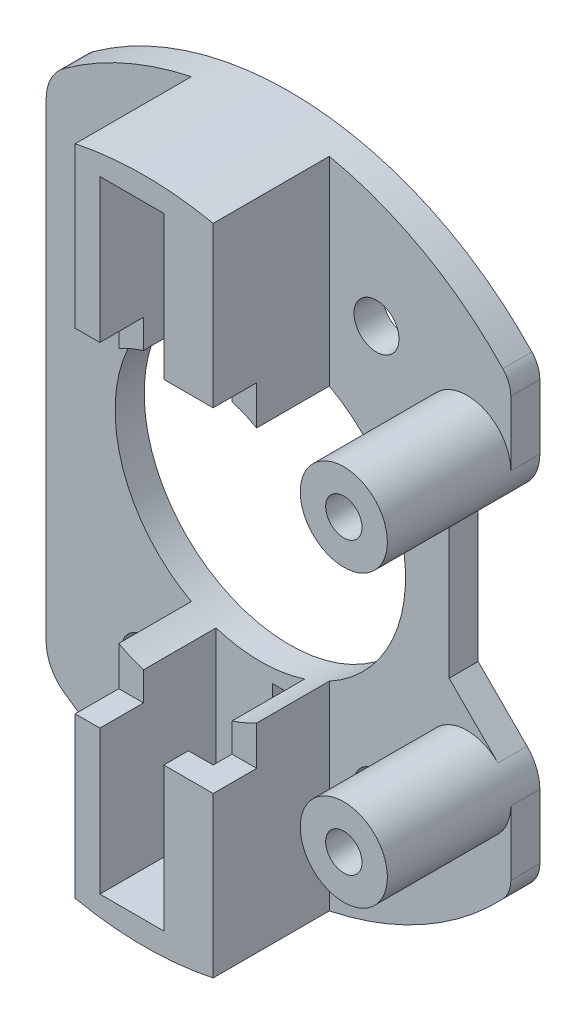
ISO-10303-21;
HEADER;
FILE_DESCRIPTION(('STEP AP214'),'2;1');
FILE_NAME('part.step','',(''),(''),'','','');
FILE_SCHEMA(('AUTOMOTIVE_DESIGN { 1 0 10303 214 1 1 1 1 }'));
ENDSEC;
DATA;
#1=APPLICATION_CONTEXT('core data for automotive mechanical design processes');
#2=APPLICATION_PROTOCOL_DEFINITION('international standard','automotive_design',2000,#1);
#3=PRODUCT_CONTEXT('',#1,'mechanical');
#4=PRODUCT('Part','Part','',(#3));
#5=PRODUCT_RELATED_PRODUCT_CATEGORY('part','',(#4));
#6=PRODUCT_DEFINITION_FORMATION('','',#4);
#7=PRODUCT_DEFINITION_CONTEXT('part definition',#1,'design');
#8=PRODUCT_DEFINITION('design','',#6,#7);
#9=PRODUCT_DEFINITION_SHAPE('','',#8);
#10=(LENGTH_UNIT() NAMED_UNIT(*) SI_UNIT(.MILLI.,.METRE.));
#11=(NAMED_UNIT(*) PLANE_ANGLE_UNIT() SI_UNIT($,.RADIAN.));
#12=(NAMED_UNIT(*) SI_UNIT($,.STERADIAN.) SOLID_ANGLE_UNIT());
#13=UNCERTAINTY_MEASURE_WITH_UNIT(LENGTH_MEASURE(1.E-05),#10,'distance_accuracy_value','');
#14=(GEOMETRIC_REPRESENTATION_CONTEXT(3) GLOBAL_UNCERTAINTY_ASSIGNED_CONTEXT((#13)) GLOBAL_UNIT_ASSIGNED_CONTEXT((#10,
#11,#12)) REPRESENTATION_CONTEXT('',''));
#15=CARTESIAN_POINT('',(0.,0.,0.));
#16=DIRECTION('',(0.,0.,1.));
#17=DIRECTION('',(1.,0.,0.));
#18=AXIS2_PLACEMENT_3D('',#15,#16,#17);
#19=CARTESIAN_POINT('',(14.25,14.7844716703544,2.));
#20=DIRECTION('',(0.,0.,-1.));
#21=DIRECTION('',(-1.,0.,0.));
#22=AXIS2_PLACEMENT_3D('',#19,#20,#21);
#23=PLANE('',#22);
#24=DIRECTION('',(0.,-1.,0.));
#25=VECTOR('',#24,1.);
#26=CARTESIAN_POINT('',(3.05,3.3771123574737,2.));
#27=LINE('',#26,#25);
#28=CARTESIAN_POINT('',(3.05,15.2535888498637,2.));
#29=VERTEX_POINT('',#28);
#30=CARTESIAN_POINT('',(3.05,13.8771123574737,2.));
#31=VERTEX_POINT('',#30);
#32=EDGE_CURVE('E653',#29,#31,#27,.T.);
#33=ORIENTED_EDGE('',*,*,#32,.F.);
#34=CARTESIAN_POINT('',(0.,24.7771123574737,2.));
#35=DIRECTION('',(0.,0.,1.));
#36=DIRECTION('',(1.,0.,0.));
#37=AXIS2_PLACEMENT_3D('',#34,#35,#36);
#38=CIRCLE('',#37,10.);
#39=CARTESIAN_POINT('',(-3.04999999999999,15.2535888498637,2.));
#40=VERTEX_POINT('',#39);
#41=EDGE_CURVE('E588',#40,#29,#38,.T.);
#42=ORIENTED_EDGE('',*,*,#41,.F.);
#43=DIRECTION('',(0.,1.,0.));
#44=VECTOR('',#43,1.);
#45=CARTESIAN_POINT('',(-3.04999999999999,3.3771123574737,2.));
#46=LINE('',#45,#44);
#47=CARTESIAN_POINT('',(-3.04999999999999,3.3771123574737,2.));
#48=VERTEX_POINT('',#47);
#49=EDGE_CURVE('E711',#48,#40,#46,.T.);
#50=ORIENTED_EDGE('',*,*,#49,.F.);
#51=DIRECTION('',(-1.,0.,0.));
#52=VECTOR('',#51,1.);
#53=CARTESIAN_POINT('',(3.05,3.3771123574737,2.));
#54=LINE('',#53,#52);
#55=CARTESIAN_POINT('',(0.85,3.3771123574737,2.));
#56=VERTEX_POINT('',#55);
#57=EDGE_CURVE('E663',#56,#48,#54,.T.);
#58=ORIENTED_EDGE('',*,*,#57,.F.);
#59=DIRECTION('',(0.,-1.,0.));
#60=VECTOR('',#59,1.);
#61=CARTESIAN_POINT('',(0.849999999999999,3.37711235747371,2.));
#62=LINE('',#61,#60);
#63=CARTESIAN_POINT('',(0.849999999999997,13.8771123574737,2.));
#64=VERTEX_POINT('',#63);
#65=EDGE_CURVE('E629',#64,#56,#62,.T.);
#66=ORIENTED_EDGE('',*,*,#65,.F.);
#67=DIRECTION('',(-1.,0.,0.));
#68=VECTOR('',#67,1.);
#69=CARTESIAN_POINT('',(3.05,13.8771123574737,2.));
#70=LINE('',#69,#68);
#71=EDGE_CURVE('E632',#31,#64,#70,.T.);
#72=ORIENTED_EDGE('',*,*,#71,.F.);
#73=EDGE_LOOP('',(#33,#42,#50,#58,#66,#72));
#74=FACE_BOUND('',#73,.T.);
#75=ADVANCED_FACE('F29',(#74),#23,.F.);
#76=CARTESIAN_POINT('',(-7.99999999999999,10.7771123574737,2.));
#77=DIRECTION('',(0.,0.,1.));
#78=DIRECTION('',(1.,0.,0.));
#79=AXIS2_PLACEMENT_3D('',#76,#77,#78);
#80=CIRCLE('',#79,1.55);
#81=CARTESIAN_POINT('',(-6.44999999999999,10.7771123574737,2.));
#82=VERTEX_POINT('',#81);
#83=EDGE_CURVE('E578',#82,#82,#80,.T.);
#84=ORIENTED_EDGE('',*,*,#83,.F.);
#85=EDGE_LOOP('',(#84));
#86=FACE_BOUND('',#85,.T.);
#87=CARTESIAN_POINT('',(-8.,38.7771123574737,2.));
#88=DIRECTION('',(0.,0.,1.));
#89=DIRECTION('',(1.,0.,0.));
#90=AXIS2_PLACEMENT_3D('',#87,#88,#89);
#91=CIRCLE('',#90,1.55000000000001);
#92=CARTESIAN_POINT('',(-6.44999999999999,38.7771123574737,2.));
#93=VERTEX_POINT('',#92);
#94=EDGE_CURVE('E560',#93,#93,#91,.T.);
#95=ORIENTED_EDGE('',*,*,#94,.F.);
#96=EDGE_LOOP('',(#95));
#97=FACE_BOUND('',#96,.T.);
#98=DIRECTION('',(0.,-1.,0.));
#99=VECTOR('',#98,1.);
#100=CARTESIAN_POINT('',(-4.74999999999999,2.27294607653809,2.));
#101=LINE('',#100,#99);
#102=CARTESIAN_POINT('',(-4.74999999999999,15.9772544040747,2.));
#103=VERTEX_POINT('',#102);
#104=CARTESIAN_POINT('',(-4.74999999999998,2.27294607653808,2.));
#105=VERTEX_POINT('',#104);
#106=EDGE_CURVE('E714',#103,#105,#101,.T.);
#107=ORIENTED_EDGE('',*,*,#106,.F.);
#108=CARTESIAN_POINT('',(-4.74999999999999,33.5769703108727,2.));
#109=VERTEX_POINT('',#108);
#110=EDGE_CURVE('E585',#109,#103,#38,.T.);
#111=ORIENTED_EDGE('',*,*,#110,.F.);
#112=DIRECTION('',(0.,-1.,0.));
#113=VECTOR('',#112,1.);
#114=CARTESIAN_POINT('',(-4.74999999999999,47.2812786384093,2.));
#115=LINE('',#114,#113);
#116=CARTESIAN_POINT('',(-4.74999999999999,47.2812786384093,2.));
#117=VERTEX_POINT('',#116);
#118=EDGE_CURVE('E395',#117,#109,#115,.T.);
#119=ORIENTED_EDGE('',*,*,#118,.F.);
#120=CARTESIAN_POINT('',(0.,24.7771123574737,2.));
#121=DIRECTION('',(0.,0.,1.));
#122=DIRECTION('',(1.,0.,0.));
#123=AXIS2_PLACEMENT_3D('',#120,#121,#122);
#124=CIRCLE('',#123,23.);
#125=CARTESIAN_POINT('',(-13.5125,43.3892681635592,2.));
#126=VERTEX_POINT('',#125);
#127=EDGE_CURVE('E525',#117,#126,#124,.T.);
#128=ORIENTED_EDGE('',*,*,#127,.T.);
#129=CARTESIAN_POINT('',(-11.75,40.9615956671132,2.));
#130=DIRECTION('',(0.,0.,1.));
#131=DIRECTION('',(-1.,0.,0.));
#132=AXIS2_PLACEMENT_3D('',#129,#130,#131);
#133=CIRCLE('',#132,3.);
#134=CARTESIAN_POINT('',(-14.75,40.9615956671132,2.));
#135=VERTEX_POINT('',#134);
#136=EDGE_CURVE('E520',#126,#135,#133,.T.);
#137=ORIENTED_EDGE('',*,*,#136,.T.);
#138=DIRECTION('',(0.,-1.,0.));
#139=VECTOR('',#138,1.);
#140=CARTESIAN_POINT('',(-14.75,40.9615956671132,2.));
#141=LINE('',#140,#139);
#142=CARTESIAN_POINT('',(-14.75,8.59262904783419,2.));
#143=VERTEX_POINT('',#142);
#144=EDGE_CURVE('E518',#135,#143,#141,.T.);
#145=ORIENTED_EDGE('',*,*,#144,.T.);
#146=CARTESIAN_POINT('',(-11.75,8.59262904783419,2.));
#147=DIRECTION('',(0.,0.,1.));
#148=DIRECTION('',(-1.,0.,0.));
#149=AXIS2_PLACEMENT_3D('',#146,#147,#148);
#150=CIRCLE('',#149,3.);
#151=CARTESIAN_POINT('',(-13.5125,6.16495655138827,2.));
#152=VERTEX_POINT('',#151);
#153=EDGE_CURVE('E516',#143,#152,#150,.T.);
#154=ORIENTED_EDGE('',*,*,#153,.T.);
#155=CARTESIAN_POINT('',(0.,24.7771123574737,2.));
#156=DIRECTION('',(0.,0.,1.));
#157=DIRECTION('',(1.,0.,0.));
#158=AXIS2_PLACEMENT_3D('',#155,#156,#157);
#159=CIRCLE('',#158,23.);
#160=EDGE_CURVE('E512',#152,#105,#159,.T.);
#161=ORIENTED_EDGE('',*,*,#160,.T.);
#162=EDGE_LOOP('',(#107,#111,#119,#128,#137,#145,#154,#161));
#163=FACE_BOUND('',#162,.T.);
#164=ADVANCED_FACE('F868',(#86,#97,#163),#23,.F.);
#165=CARTESIAN_POINT('',(8.,38.7771123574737,2.));
#166=DIRECTION('',(0.,0.,1.));
#167=DIRECTION('',(1.,0.,0.));
#168=AXIS2_PLACEMENT_3D('',#165,#166,#167);
#169=CIRCLE('',#168,1.55);
#170=CARTESIAN_POINT('',(9.55,38.7771123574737,2.));
#171=VERTEX_POINT('',#170);
#172=EDGE_CURVE('E566',#171,#171,#169,.T.);
#173=ORIENTED_EDGE('',*,*,#172,.F.);
#174=EDGE_LOOP('',(#173));
#175=FACE_BOUND('',#174,.T.);
#176=CARTESIAN_POINT('',(8.,10.7771123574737,2.));
#177=DIRECTION('',(0.,0.,1.));
#178=DIRECTION('',(1.,0.,0.));
#179=AXIS2_PLACEMENT_3D('',#176,#177,#178);
#180=CIRCLE('',#179,1.55);
#181=CARTESIAN_POINT('',(9.55,10.7771123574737,2.));
#182=VERTEX_POINT('',#181);
#183=EDGE_CURVE('E572',#182,#182,#180,.T.);
#184=ORIENTED_EDGE('',*,*,#183,.F.);
#185=EDGE_LOOP('',(#184));
#186=FACE_BOUND('',#185,.T.);
#187=DIRECTION('',(0.,1.,0.));
#188=VECTOR('',#187,1.);
#189=CARTESIAN_POINT('',(4.75,2.27294607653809,2.));
#190=LINE('',#189,#188);
#191=CARTESIAN_POINT('',(4.75,2.27294607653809,2.));
#192=VERTEX_POINT('',#191);
#193=CARTESIAN_POINT('',(4.75,15.9772544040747,2.));
#194=VERTEX_POINT('',#193);
#195=EDGE_CURVE('E368',#192,#194,#190,.T.);
#196=ORIENTED_EDGE('',*,*,#195,.F.);
#197=CARTESIAN_POINT('',(16.702380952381,8.96476052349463,2.));
#198=VERTEX_POINT('',#197);
#199=EDGE_CURVE('E515',#192,#198,#159,.T.);
#200=ORIENTED_EDGE('',*,*,#199,.T.);
#201=CARTESIAN_POINT('',(15.25,10.3397476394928,2.));
#202=DIRECTION('',(0.,0.,1.));
#203=DIRECTION('',(-1.,0.,0.));
#204=AXIS2_PLACEMENT_3D('',#201,#202,#203);
#205=CIRCLE('',#204,2.);
#206=CARTESIAN_POINT('',(17.25,10.3397476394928,2.));
#207=VERTEX_POINT('',#206);
#208=EDGE_CURVE('E510',#198,#207,#205,.T.);
#209=ORIENTED_EDGE('',*,*,#208,.T.);
#210=DIRECTION('',(0.,1.,0.));
#211=VECTOR('',#210,1.);
#212=CARTESIAN_POINT('',(17.25,14.7844716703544,2.));
#213=LINE('',#212,#211);
#214=CARTESIAN_POINT('',(17.25,14.7844716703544,2.));
#215=VERTEX_POINT('',#214);
#216=EDGE_CURVE('E508',#207,#215,#213,.T.);
#217=ORIENTED_EDGE('',*,*,#216,.T.);
#218=CARTESIAN_POINT('',(14.25,14.7844716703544,2.));
#219=DIRECTION('',(0.,0.,1.));
#220=DIRECTION('',(1.,0.,0.));
#221=AXIS2_PLACEMENT_3D('',#218,#219,#220);
#222=CIRCLE('',#221,3.);
#223=CARTESIAN_POINT('',(16.3713203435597,16.905792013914,2.));
#224=VERTEX_POINT('',#223);
#225=EDGE_CURVE('E430',#224,#215,#222,.T.);
#226=ORIENTED_EDGE('',*,*,#225,.F.);
#227=DIRECTION('',(-0.707106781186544,0.707106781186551,0.));
#228=VECTOR('',#227,1.);
#229=CARTESIAN_POINT('',(13.,20.2771123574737,2.));
#230=LINE('',#229,#228);
#231=CARTESIAN_POINT('',(13.,20.2771123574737,2.));
#232=VERTEX_POINT('',#231);
#233=EDGE_CURVE('E528',#224,#232,#230,.T.);
#234=ORIENTED_EDGE('',*,*,#233,.T.);
#235=DIRECTION('',(0.,1.,0.));
#236=VECTOR('',#235,1.);
#237=CARTESIAN_POINT('',(13.,29.2771123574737,2.));
#238=LINE('',#237,#236);
#239=CARTESIAN_POINT('',(13.,29.2771123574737,2.));
#240=VERTEX_POINT('',#239);
#241=EDGE_CURVE('E463',#232,#240,#238,.T.);
#242=ORIENTED_EDGE('',*,*,#241,.T.);
#243=DIRECTION('',(0.707106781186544,0.707106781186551,0.));
#244=VECTOR('',#243,1.);
#245=CARTESIAN_POINT('',(13.,29.2771123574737,2.));
#246=LINE('',#245,#244);
#247=CARTESIAN_POINT('',(16.3713203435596,32.6484327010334,2.));
#248=VERTEX_POINT('',#247);
#249=EDGE_CURVE('E452',#240,#248,#246,.T.);
#250=ORIENTED_EDGE('',*,*,#249,.T.);
#251=CARTESIAN_POINT('',(14.25,34.769753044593,2.));
#252=DIRECTION('',(0.,0.,1.));
#253=DIRECTION('',(1.,0.,0.));
#254=AXIS2_PLACEMENT_3D('',#251,#252,#253);
#255=CIRCLE('',#254,3.);
#256=CARTESIAN_POINT('',(17.25,34.769753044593,2.));
#257=VERTEX_POINT('',#256);
#258=EDGE_CURVE('E436',#257,#248,#255,.T.);
#259=ORIENTED_EDGE('',*,*,#258,.F.);
#260=DIRECTION('',(0.,1.,0.));
#261=VECTOR('',#260,1.);
#262=CARTESIAN_POINT('',(17.25,39.2144770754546,2.));
#263=LINE('',#262,#261);
#264=CARTESIAN_POINT('',(17.25,39.2144770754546,2.));
#265=VERTEX_POINT('',#264);
#266=EDGE_CURVE('E449',#257,#265,#263,.T.);
#267=ORIENTED_EDGE('',*,*,#266,.T.);
#268=CARTESIAN_POINT('',(15.25,39.2144770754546,2.));
#269=DIRECTION('',(0.,0.,1.));
#270=DIRECTION('',(-1.,0.,0.));
#271=AXIS2_PLACEMENT_3D('',#268,#269,#270);
#272=CIRCLE('',#271,2.);
#273=CARTESIAN_POINT('',(16.7023809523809,40.5894641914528,2.));
#274=VERTEX_POINT('',#273);
#275=EDGE_CURVE('E451',#265,#274,#272,.T.);
#276=ORIENTED_EDGE('',*,*,#275,.T.);
#277=CARTESIAN_POINT('',(4.74999999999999,47.2812786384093,2.));
#278=VERTEX_POINT('',#277);
#279=EDGE_CURVE('E522',#274,#278,#124,.T.);
#280=ORIENTED_EDGE('',*,*,#279,.T.);
#281=DIRECTION('',(0.,1.,0.));
#282=VECTOR('',#281,1.);
#283=CARTESIAN_POINT('',(4.74999999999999,47.2812786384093,2.));
#284=LINE('',#283,#282);
#285=CARTESIAN_POINT('',(4.75,33.5769703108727,2.));
#286=VERTEX_POINT('',#285);
#287=EDGE_CURVE('E393',#286,#278,#284,.T.);
#288=ORIENTED_EDGE('',*,*,#287,.F.);
#289=EDGE_CURVE('E589',#194,#286,#38,.T.);
#290=ORIENTED_EDGE('',*,*,#289,.F.);
#291=EDGE_LOOP('',(#196,#200,#209,#217,#226,#234,#242,#250,#259,#267,#276,#280,#288,#290));
#292=FACE_BOUND('',#291,.T.);
#293=ADVANCED_FACE('F727',(#175,#186,#292),#23,.F.);
#294=DIRECTION('',(0.,-1.,0.));
#295=VECTOR('',#294,1.);
#296=CARTESIAN_POINT('',(3.04999999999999,46.1771123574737,2.));
#297=LINE('',#296,#295);
#298=CARTESIAN_POINT('',(3.04999999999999,35.6771123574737,2.));
#299=VERTEX_POINT('',#298);
#300=CARTESIAN_POINT('',(3.05,34.3006358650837,2.));
#301=VERTEX_POINT('',#300);
#302=EDGE_CURVE('E390',#299,#301,#297,.T.);
#303=ORIENTED_EDGE('',*,*,#302,.F.);
#304=DIRECTION('',(1.,0.,0.));
#305=VECTOR('',#304,1.);
#306=CARTESIAN_POINT('',(3.04999999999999,35.6771123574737,2.));
#307=LINE('',#306,#305);
#308=CARTESIAN_POINT('',(0.849999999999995,35.6771123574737,2.));
#309=VERTEX_POINT('',#308);
#310=EDGE_CURVE('E603',#309,#299,#307,.T.);
#311=ORIENTED_EDGE('',*,*,#310,.F.);
#312=DIRECTION('',(0.,-1.,0.));
#313=VECTOR('',#312,1.);
#314=CARTESIAN_POINT('',(0.849999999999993,46.1771123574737,2.));
#315=LINE('',#314,#313);
#316=CARTESIAN_POINT('',(0.849999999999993,46.1771123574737,2.));
#317=VERTEX_POINT('',#316);
#318=EDGE_CURVE('E606',#317,#309,#315,.T.);
#319=ORIENTED_EDGE('',*,*,#318,.F.);
#320=DIRECTION('',(1.,0.,0.));
#321=VECTOR('',#320,1.);
#322=CARTESIAN_POINT('',(3.04999999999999,46.1771123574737,2.));
#323=LINE('',#322,#321);
#324=CARTESIAN_POINT('',(-3.04999999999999,46.1771123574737,2.));
#325=VERTEX_POINT('',#324);
#326=EDGE_CURVE('E400',#325,#317,#323,.T.);
#327=ORIENTED_EDGE('',*,*,#326,.F.);
#328=DIRECTION('',(0.,1.,0.));
#329=VECTOR('',#328,1.);
#330=CARTESIAN_POINT('',(-3.04999999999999,46.1771123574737,2.));
#331=LINE('',#330,#329);
#332=CARTESIAN_POINT('',(-3.04999999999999,34.3006358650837,2.));
#333=VERTEX_POINT('',#332);
#334=EDGE_CURVE('E398',#333,#325,#331,.T.);
#335=ORIENTED_EDGE('',*,*,#334,.F.);
#336=EDGE_CURVE('E584',#301,#333,#38,.T.);
#337=ORIENTED_EDGE('',*,*,#336,.F.);
#338=EDGE_LOOP('',(#303,#311,#319,#327,#335,#337));
#339=FACE_BOUND('',#338,.T.);
#340=ADVANCED_FACE('F741',(#339),#23,.F.);
#341=CARTESIAN_POINT('',(14.25,14.7844716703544,0.));
#342=DIRECTION('',(0.,0.,-1.));
#343=DIRECTION('',(-1.,0.,0.));
#344=AXIS2_PLACEMENT_3D('',#341,#342,#343);
#345=PLANE('',#344);
#346=CARTESIAN_POINT('',(14.25,14.7844716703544,0.));
#347=DIRECTION('',(0.,0.,-1.));
#348=DIRECTION('',(-1.,0.,0.));
#349=AXIS2_PLACEMENT_3D('',#346,#347,#348);
#350=CIRCLE('',#349,1.25);
#351=CARTESIAN_POINT('',(13.,14.7844716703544,0.));
#352=VERTEX_POINT('',#351);
#353=EDGE_CURVE('E833',#352,#352,#350,.T.);
#354=ORIENTED_EDGE('',*,*,#353,.F.);
#355=EDGE_LOOP('',(#354));
#356=FACE_BOUND('',#355,.T.);
#357=CARTESIAN_POINT('',(14.25,34.769753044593,0.));
#358=DIRECTION('',(0.,0.,-1.));
#359=DIRECTION('',(-1.,0.,0.));
#360=AXIS2_PLACEMENT_3D('',#357,#358,#359);
#361=CIRCLE('',#360,1.25);
#362=CARTESIAN_POINT('',(13.,34.769753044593,0.));
#363=VERTEX_POINT('',#362);
#364=EDGE_CURVE('E827',#363,#363,#361,.T.);
#365=ORIENTED_EDGE('',*,*,#364,.F.);
#366=EDGE_LOOP('',(#365));
#367=FACE_BOUND('',#366,.T.);
#368=DIRECTION('',(-1.,0.,0.));
#369=VECTOR('',#368,1.);
#370=CARTESIAN_POINT('',(3.04999999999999,46.1771123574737,0.));
#371=LINE('',#370,#369);
#372=CARTESIAN_POINT('',(3.04999999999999,46.1771123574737,0.));
#373=VERTEX_POINT('',#372);
#374=CARTESIAN_POINT('',(0.849999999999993,46.1771123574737,0.));
#375=VERTEX_POINT('',#374);
#376=EDGE_CURVE('E608',#373,#375,#371,.T.);
#377=ORIENTED_EDGE('',*,*,#376,.T.);
#378=DIRECTION('',(0.,-1.,0.));
#379=VECTOR('',#378,1.);
#380=CARTESIAN_POINT('',(0.849999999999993,46.1771123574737,0.));
#381=LINE('',#380,#379);
#382=CARTESIAN_POINT('',(0.849999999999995,35.6771123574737,0.));
#383=VERTEX_POINT('',#382);
#384=EDGE_CURVE('E617',#375,#383,#381,.T.);
#385=ORIENTED_EDGE('',*,*,#384,.T.);
#386=DIRECTION('',(1.,0.,0.));
#387=VECTOR('',#386,1.);
#388=CARTESIAN_POINT('',(3.04999999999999,35.6771123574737,0.));
#389=LINE('',#388,#387);
#390=CARTESIAN_POINT('',(3.04999999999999,35.6771123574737,0.));
#391=VERTEX_POINT('',#390);
#392=EDGE_CURVE('E614',#383,#391,#389,.T.);
#393=ORIENTED_EDGE('',*,*,#392,.T.);
#394=DIRECTION('',(0.,1.,0.));
#395=VECTOR('',#394,1.);
#396=CARTESIAN_POINT('',(3.04999999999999,46.1771123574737,0.));
#397=LINE('',#396,#395);
#398=EDGE_CURVE('E611',#391,#373,#397,.T.);
#399=ORIENTED_EDGE('',*,*,#398,.T.);
#400=EDGE_LOOP('',(#377,#385,#393,#399));
#401=FACE_BOUND('',#400,.T.);
#402=CARTESIAN_POINT('',(-7.99999999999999,10.7771123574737,0.));
#403=DIRECTION('',(0.,0.,1.));
#404=DIRECTION('',(1.,0.,0.));
#405=AXIS2_PLACEMENT_3D('',#402,#403,#404);
#406=CIRCLE('',#405,1.55);
#407=CARTESIAN_POINT('',(-6.44999999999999,10.7771123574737,0.));
#408=VERTEX_POINT('',#407);
#409=EDGE_CURVE('E581',#408,#408,#406,.T.);
#410=ORIENTED_EDGE('',*,*,#409,.T.);
#411=EDGE_LOOP('',(#410));
#412=FACE_BOUND('',#411,.T.);
#413=CARTESIAN_POINT('',(8.,38.7771123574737,0.));
#414=DIRECTION('',(0.,0.,1.));
#415=DIRECTION('',(1.,0.,0.));
#416=AXIS2_PLACEMENT_3D('',#413,#414,#415);
#417=CIRCLE('',#416,1.55);
#418=CARTESIAN_POINT('',(9.55,38.7771123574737,0.));
#419=VERTEX_POINT('',#418);
#420=EDGE_CURVE('E569',#419,#419,#417,.T.);
#421=ORIENTED_EDGE('',*,*,#420,.T.);
#422=EDGE_LOOP('',(#421));
#423=FACE_BOUND('',#422,.T.);
#424=DIRECTION('',(-0.707106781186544,0.707106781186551,0.));
#425=VECTOR('',#424,1.);
#426=CARTESIAN_POINT('',(13.,20.2771123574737,0.));
#427=LINE('',#426,#425);
#428=CARTESIAN_POINT('',(16.3713203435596,16.905792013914,0.));
#429=VERTEX_POINT('',#428);
#430=CARTESIAN_POINT('',(13.,20.2771123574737,0.));
#431=VERTEX_POINT('',#430);
#432=EDGE_CURVE('E557',#429,#431,#427,.T.);
#433=ORIENTED_EDGE('',*,*,#432,.F.);
#434=CARTESIAN_POINT('',(14.25,14.7844716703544,0.));
#435=DIRECTION('',(0.,0.,1.));
#436=DIRECTION('',(-1.,0.,0.));
#437=AXIS2_PLACEMENT_3D('',#434,#435,#436);
#438=CIRCLE('',#437,2.99999999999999);
#439=CARTESIAN_POINT('',(17.25,14.7844716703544,0.));
#440=VERTEX_POINT('',#439);
#441=EDGE_CURVE('E531',#440,#429,#438,.T.);
#442=ORIENTED_EDGE('',*,*,#441,.F.);
#443=DIRECTION('',(0.,1.,0.));
#444=VECTOR('',#443,1.);
#445=CARTESIAN_POINT('',(17.25,14.7844716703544,0.));
#446=LINE('',#445,#444);
#447=CARTESIAN_POINT('',(17.25,10.3397476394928,0.));
#448=VERTEX_POINT('',#447);
#449=EDGE_CURVE('E533',#448,#440,#446,.T.);
#450=ORIENTED_EDGE('',*,*,#449,.F.);
#451=CARTESIAN_POINT('',(15.25,10.3397476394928,0.));
#452=DIRECTION('',(0.,0.,1.));
#453=DIRECTION('',(-1.,0.,0.));
#454=AXIS2_PLACEMENT_3D('',#451,#452,#453);
#455=CIRCLE('',#454,2.);
#456=CARTESIAN_POINT('',(16.702380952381,8.96476052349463,0.));
#457=VERTEX_POINT('',#456);
#458=EDGE_CURVE('E535',#457,#448,#455,.T.);
#459=ORIENTED_EDGE('',*,*,#458,.F.);
#460=CARTESIAN_POINT('',(0.,24.7771123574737,0.));
#461=DIRECTION('',(0.,0.,1.));
#462=DIRECTION('',(1.,0.,0.));
#463=AXIS2_PLACEMENT_3D('',#460,#461,#462);
#464=CIRCLE('',#463,23.);
#465=CARTESIAN_POINT('',(-13.5125,6.16495655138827,0.));
#466=VERTEX_POINT('',#465);
#467=EDGE_CURVE('E537',#466,#457,#464,.T.);
#468=ORIENTED_EDGE('',*,*,#467,.F.);
#469=CARTESIAN_POINT('',(-11.75,8.59262904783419,0.));
#470=DIRECTION('',(0.,0.,1.));
#471=DIRECTION('',(-1.,0.,0.));
#472=AXIS2_PLACEMENT_3D('',#469,#470,#471);
#473=CIRCLE('',#472,3.);
#474=CARTESIAN_POINT('',(-14.75,8.59262904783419,0.));
#475=VERTEX_POINT('',#474);
#476=EDGE_CURVE('E539',#475,#466,#473,.T.);
#477=ORIENTED_EDGE('',*,*,#476,.F.);
#478=DIRECTION('',(0.,-1.,0.));
#479=VECTOR('',#478,1.);
#480=CARTESIAN_POINT('',(-14.75,40.9615956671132,0.));
#481=LINE('',#480,#479);
#482=CARTESIAN_POINT('',(-14.75,40.9615956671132,0.));
#483=VERTEX_POINT('',#482);
#484=EDGE_CURVE('E541',#483,#475,#481,.T.);
#485=ORIENTED_EDGE('',*,*,#484,.F.);
#486=CARTESIAN_POINT('',(-11.75,40.9615956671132,0.));
#487=DIRECTION('',(0.,0.,1.));
#488=DIRECTION('',(-1.,0.,0.));
#489=AXIS2_PLACEMENT_3D('',#486,#487,#488);
#490=CIRCLE('',#489,3.);
#491=CARTESIAN_POINT('',(-13.5125,43.3892681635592,0.));
#492=VERTEX_POINT('',#491);
#493=EDGE_CURVE('E543',#492,#483,#490,.T.);
#494=ORIENTED_EDGE('',*,*,#493,.F.);
#495=CARTESIAN_POINT('',(0.,24.7771123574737,0.));
#496=DIRECTION('',(0.,0.,1.));
#497=DIRECTION('',(1.,0.,0.));
#498=AXIS2_PLACEMENT_3D('',#495,#496,#497);
#499=CIRCLE('',#498,23.);
#500=CARTESIAN_POINT('',(16.7023809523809,40.5894641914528,0.));
#501=VERTEX_POINT('',#500);
#502=EDGE_CURVE('E545',#501,#492,#499,.T.);
#503=ORIENTED_EDGE('',*,*,#502,.F.);
#504=CARTESIAN_POINT('',(15.25,39.2144770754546,0.));
#505=DIRECTION('',(0.,0.,1.));
#506=DIRECTION('',(-1.,0.,0.));
#507=AXIS2_PLACEMENT_3D('',#504,#505,#506);
#508=CIRCLE('',#507,2.);
#509=CARTESIAN_POINT('',(17.25,39.2144770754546,0.));
#510=VERTEX_POINT('',#509);
#511=EDGE_CURVE('E547',#510,#501,#508,.T.);
#512=ORIENTED_EDGE('',*,*,#511,.F.);
#513=DIRECTION('',(0.,1.,0.));
#514=VECTOR('',#513,1.);
#515=CARTESIAN_POINT('',(17.25,39.2144770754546,0.));
#516=LINE('',#515,#514);
#517=CARTESIAN_POINT('',(17.25,34.769753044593,0.));
#518=VERTEX_POINT('',#517);
#519=EDGE_CURVE('E549',#518,#510,#516,.T.);
#520=ORIENTED_EDGE('',*,*,#519,.F.);
#521=CARTESIAN_POINT('',(14.25,34.769753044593,0.));
#522=DIRECTION('',(0.,0.,1.));
#523=DIRECTION('',(-1.,0.,0.));
#524=AXIS2_PLACEMENT_3D('',#521,#522,#523);
#525=CIRCLE('',#524,2.99999999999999);
#526=CARTESIAN_POINT('',(16.3713203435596,32.6484327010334,0.));
#527=VERTEX_POINT('',#526);
#528=EDGE_CURVE('E551',#527,#518,#525,.T.);
#529=ORIENTED_EDGE('',*,*,#528,.F.);
#530=DIRECTION('',(0.707106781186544,0.707106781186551,0.));
#531=VECTOR('',#530,1.);
#532=CARTESIAN_POINT('',(13.,29.2771123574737,0.));
#533=LINE('',#532,#531);
#534=CARTESIAN_POINT('',(13.,29.2771123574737,0.));
#535=VERTEX_POINT('',#534);
#536=EDGE_CURVE('E553',#535,#527,#533,.T.);
#537=ORIENTED_EDGE('',*,*,#536,.F.);
#538=DIRECTION('',(0.,1.,0.));
#539=VECTOR('',#538,1.);
#540=CARTESIAN_POINT('',(13.,29.2771123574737,0.));
#541=LINE('',#540,#539);
#542=EDGE_CURVE('E555',#431,#535,#541,.T.);
#543=ORIENTED_EDGE('',*,*,#542,.F.);
#544=EDGE_LOOP('',(#433,#442,#450,#459,#468,#477,#485,#494,#503,#512,#520,#529,#537,#543));
#545=FACE_BOUND('',#544,.T.);
#546=CARTESIAN_POINT('',(-8.,38.7771123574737,0.));
#547=DIRECTION('',(0.,0.,1.));
#548=DIRECTION('',(1.,0.,0.));
#549=AXIS2_PLACEMENT_3D('',#546,#547,#548);
#550=CIRCLE('',#549,1.55000000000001);
#551=CARTESIAN_POINT('',(-6.44999999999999,38.7771123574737,0.));
#552=VERTEX_POINT('',#551);
#553=EDGE_CURVE('E563',#552,#552,#550,.T.);
#554=ORIENTED_EDGE('',*,*,#553,.T.);
#555=EDGE_LOOP('',(#554));
#556=FACE_BOUND('',#555,.T.);
#557=CARTESIAN_POINT('',(8.,10.7771123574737,0.));
#558=DIRECTION('',(0.,0.,1.));
#559=DIRECTION('',(1.,0.,0.));
#560=AXIS2_PLACEMENT_3D('',#557,#558,#559);
#561=CIRCLE('',#560,1.55);
#562=CARTESIAN_POINT('',(9.55,10.7771123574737,0.));
#563=VERTEX_POINT('',#562);
#564=EDGE_CURVE('E575',#563,#563,#561,.T.);
#565=ORIENTED_EDGE('',*,*,#564,.T.);
#566=EDGE_LOOP('',(#565));
#567=FACE_BOUND('',#566,.T.);
#568=CARTESIAN_POINT('',(0.,24.7771123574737,0.));
#569=DIRECTION('',(0.,0.,1.));
#570=DIRECTION('',(1.,0.,0.));
#571=AXIS2_PLACEMENT_3D('',#568,#569,#570);
#572=CIRCLE('',#571,10.);
#573=CARTESIAN_POINT('',(10.,24.7771123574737,0.));
#574=VERTEX_POINT('',#573);
#575=EDGE_CURVE('E590',#574,#574,#572,.T.);
#576=ORIENTED_EDGE('',*,*,#575,.T.);
#577=EDGE_LOOP('',(#576));
#578=FACE_BOUND('',#577,.T.);
#579=DIRECTION('',(1.,0.,0.));
#580=VECTOR('',#579,1.);
#581=CARTESIAN_POINT('',(3.05,3.37711235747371,0.));
#582=LINE('',#581,#580);
#583=CARTESIAN_POINT('',(0.849999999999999,3.37711235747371,0.));
#584=VERTEX_POINT('',#583);
#585=CARTESIAN_POINT('',(3.05,3.37711235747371,0.));
#586=VERTEX_POINT('',#585);
#587=EDGE_CURVE('E634',#584,#586,#582,.T.);
#588=ORIENTED_EDGE('',*,*,#587,.T.);
#589=DIRECTION('',(0.,1.,0.));
#590=VECTOR('',#589,1.);
#591=CARTESIAN_POINT('',(3.05,3.37711235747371,0.));
#592=LINE('',#591,#590);
#593=CARTESIAN_POINT('',(3.05,13.8771123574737,0.));
#594=VERTEX_POINT('',#593);
#595=EDGE_CURVE('E440',#586,#594,#592,.T.);
#596=ORIENTED_EDGE('',*,*,#595,.T.);
#597=DIRECTION('',(-1.,0.,0.));
#598=VECTOR('',#597,1.);
#599=CARTESIAN_POINT('',(3.05,13.8771123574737,0.));
#600=LINE('',#599,#598);
#601=CARTESIAN_POINT('',(0.849999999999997,13.8771123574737,0.));
#602=VERTEX_POINT('',#601);
#603=EDGE_CURVE('E639',#594,#602,#600,.T.);
#604=ORIENTED_EDGE('',*,*,#603,.T.);
#605=DIRECTION('',(0.,-1.,0.));
#606=VECTOR('',#605,1.);
#607=CARTESIAN_POINT('',(0.849999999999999,3.37711235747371,0.));
#608=LINE('',#607,#606);
#609=EDGE_CURVE('E637',#602,#584,#608,.T.);
#610=ORIENTED_EDGE('',*,*,#609,.T.);
#611=EDGE_LOOP('',(#588,#596,#604,#610));
#612=FACE_BOUND('',#611,.T.);
#613=ADVANCED_FACE('F644',(#356,#367,#401,#412,#423,#545,#556,#567,#578,#612),#345,.T.);
#614=CARTESIAN_POINT('',(13.,20.2771123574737,2.));
#615=DIRECTION('',(-0.707106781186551,-0.707106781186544,0.));
#616=DIRECTION('',(0.707106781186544,-0.707106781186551,0.));
#617=AXIS2_PLACEMENT_3D('',#614,#615,#616);
#618=PLANE('',#617);
#619=ORIENTED_EDGE('',*,*,#432,.T.);
#620=DIRECTION('',(0.,0.,-1.));
#621=VECTOR('',#620,1.);
#622=CARTESIAN_POINT('',(13.,20.2771123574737,2.));
#623=LINE('',#622,#621);
#624=EDGE_CURVE('E37',#232,#431,#623,.T.);
#625=ORIENTED_EDGE('',*,*,#624,.F.);
#626=ORIENTED_EDGE('',*,*,#233,.F.);
#627=DIRECTION('',(0.,0.,-1.));
#628=VECTOR('',#627,1.);
#629=CARTESIAN_POINT('',(16.3713203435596,16.905792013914,2.));
#630=LINE('',#629,#628);
#631=EDGE_CURVE('E505',#224,#429,#630,.T.);
#632=ORIENTED_EDGE('',*,*,#631,.T.);
#633=EDGE_LOOP('',(#619,#625,#626,#632));
#634=FACE_BOUND('',#633,.T.);
#635=ADVANCED_FACE('F31',(#634),#618,.F.);
#636=CARTESIAN_POINT('',(13.,29.2771123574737,2.));
#637=DIRECTION('',(-1.,0.,0.));
#638=DIRECTION('',(0.,-1.,0.));
#639=AXIS2_PLACEMENT_3D('',#636,#637,#638);
#640=PLANE('',#639);
#641=ORIENTED_EDGE('',*,*,#542,.T.);
#642=DIRECTION('',(0.,0.,-1.));
#643=VECTOR('',#642,1.);
#644=CARTESIAN_POINT('',(13.,29.2771123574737,2.));
#645=LINE('',#644,#643);
#646=EDGE_CURVE('E467',#240,#535,#645,.T.);
#647=ORIENTED_EDGE('',*,*,#646,.F.);
#648=ORIENTED_EDGE('',*,*,#241,.F.);
#649=ORIENTED_EDGE('',*,*,#624,.T.);
#650=EDGE_LOOP('',(#641,#647,#648,#649));
#651=FACE_BOUND('',#650,.T.);
#652=ADVANCED_FACE('F973',(#651),#640,.F.);
#653=CARTESIAN_POINT('',(13.,29.2771123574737,2.));
#654=DIRECTION('',(-0.707106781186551,0.707106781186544,0.));
#655=DIRECTION('',(-0.707106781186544,-0.707106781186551,0.));
#656=AXIS2_PLACEMENT_3D('',#653,#654,#655);
#657=PLANE('',#656);
#658=ORIENTED_EDGE('',*,*,#536,.T.);
#659=DIRECTION('',(0.,0.,-1.));
#660=VECTOR('',#659,1.);
#661=CARTESIAN_POINT('',(16.3713203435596,32.6484327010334,2.));
#662=LINE('',#661,#660);
#663=EDGE_CURVE('E458',#248,#527,#662,.T.);
#664=ORIENTED_EDGE('',*,*,#663,.F.);
#665=ORIENTED_EDGE('',*,*,#249,.F.);
#666=ORIENTED_EDGE('',*,*,#646,.T.);
#667=EDGE_LOOP('',(#658,#664,#665,#666));
#668=FACE_BOUND('',#667,.T.);
#669=ADVANCED_FACE('F971',(#668),#657,.F.);
#670=CARTESIAN_POINT('',(14.25,34.769753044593,2.));
#671=DIRECTION('',(0.,0.,-1.));
#672=DIRECTION('',(-1.,0.,0.));
#673=AXIS2_PLACEMENT_3D('',#670,#671,#672);
#674=CYLINDRICAL_SURFACE('',#673,2.99999999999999);
#675=ORIENTED_EDGE('',*,*,#528,.T.);
#676=DIRECTION('',(0.,0.,-1.));
#677=VECTOR('',#676,1.);
#678=CARTESIAN_POINT('',(17.25,34.769753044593,2.));
#679=LINE('',#678,#677);
#680=EDGE_CURVE('E455',#257,#518,#679,.T.);
#681=ORIENTED_EDGE('',*,*,#680,.F.);
#682=ORIENTED_EDGE('',*,*,#258,.T.);
#683=ORIENTED_EDGE('',*,*,#663,.T.);
#684=EDGE_LOOP('',(#675,#681,#682,#683));
#685=FACE_BOUND('',#684,.T.);
#686=CARTESIAN_POINT('',(14.25,34.769753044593,10.5));
#687=DIRECTION('',(0.,0.,1.));
#688=DIRECTION('',(1.,0.,0.));
#689=AXIS2_PLACEMENT_3D('',#686,#687,#688);
#690=CIRCLE('',#689,3.);
#691=CARTESIAN_POINT('',(17.25,34.769753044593,10.5));
#692=VERTEX_POINT('',#691);
#693=EDGE_CURVE('E437',#692,#692,#690,.T.);
#694=ORIENTED_EDGE('',*,*,#693,.F.);
#695=EDGE_LOOP('',(#694));
#696=FACE_BOUND('',#695,.T.);
#697=ADVANCED_FACE('F969',(#685,#696),#674,.T.);
#698=CARTESIAN_POINT('',(17.25,39.2144770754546,2.));
#699=DIRECTION('',(-1.,0.,0.));
#700=DIRECTION('',(0.,-1.,0.));
#701=AXIS2_PLACEMENT_3D('',#698,#699,#700);
#702=PLANE('',#701);
#703=ORIENTED_EDGE('',*,*,#519,.T.);
#704=DIRECTION('',(0.,0.,-1.));
#705=VECTOR('',#704,1.);
#706=CARTESIAN_POINT('',(17.25,39.2144770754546,2.));
#707=LINE('',#706,#705);
#708=EDGE_CURVE('E459',#265,#510,#707,.T.);
#709=ORIENTED_EDGE('',*,*,#708,.F.);
#710=ORIENTED_EDGE('',*,*,#266,.F.);
#711=ORIENTED_EDGE('',*,*,#680,.T.);
#712=EDGE_LOOP('',(#703,#709,#710,#711));
#713=FACE_BOUND('',#712,.T.);
#714=ADVANCED_FACE('F966',(#713),#702,.F.);
#715=CARTESIAN_POINT('',(15.25,39.2144770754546,2.));
#716=DIRECTION('',(0.,0.,-1.));
#717=DIRECTION('',(-1.,0.,0.));
#718=AXIS2_PLACEMENT_3D('',#715,#716,#717);
#719=CYLINDRICAL_SURFACE('',#718,2.);
#720=ORIENTED_EDGE('',*,*,#511,.T.);
#721=DIRECTION('',(0.,0.,-1.));
#722=VECTOR('',#721,1.);
#723=CARTESIAN_POINT('',(16.7023809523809,40.5894641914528,2.));
#724=LINE('',#723,#722);
#725=EDGE_CURVE('E481',#274,#501,#724,.T.);
#726=ORIENTED_EDGE('',*,*,#725,.F.);
#727=ORIENTED_EDGE('',*,*,#275,.F.);
#728=ORIENTED_EDGE('',*,*,#708,.T.);
#729=EDGE_LOOP('',(#720,#726,#727,#728));
#730=FACE_BOUND('',#729,.T.);
#731=ADVANCED_FACE('F962',(#730),#719,.T.);
#732=CARTESIAN_POINT('',(0.,24.7771123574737,2.));
#733=DIRECTION('',(0.,0.,-1.));
#734=DIRECTION('',(-1.,0.,0.));
#735=AXIS2_PLACEMENT_3D('',#732,#733,#734);
#736=CYLINDRICAL_SURFACE('',#735,23.);
#737=ORIENTED_EDGE('',*,*,#502,.T.);
#738=DIRECTION('',(0.,0.,-1.));
#739=VECTOR('',#738,1.);
#740=CARTESIAN_POINT('',(-13.5125,43.3892681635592,2.));
#741=LINE('',#740,#739);
#742=EDGE_CURVE('E484',#126,#492,#741,.T.);
#743=ORIENTED_EDGE('',*,*,#742,.F.);
#744=ORIENTED_EDGE('',*,*,#127,.F.);
#745=DIRECTION('',(0.,0.,-1.));
#746=VECTOR('',#745,1.);
#747=CARTESIAN_POINT('',(-4.74999999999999,47.2812786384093,10.));
#748=LINE('',#747,#746);
#749=CARTESIAN_POINT('',(-4.74999999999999,47.2812786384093,10.));
#750=VERTEX_POINT('',#749);
#751=EDGE_CURVE('E421',#750,#117,#748,.T.);
#752=ORIENTED_EDGE('',*,*,#751,.F.);
#753=CARTESIAN_POINT('',(0.,24.7771123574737,10.));
#754=DIRECTION('',(0.,0.,1.));
#755=DIRECTION('',(1.,0.,0.));
#756=AXIS2_PLACEMENT_3D('',#753,#754,#755);
#757=CIRCLE('',#756,23.);
#758=CARTESIAN_POINT('',(4.74999999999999,47.2812786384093,10.));
#759=VERTEX_POINT('',#758);
#760=EDGE_CURVE('E404',#759,#750,#757,.T.);
#761=ORIENTED_EDGE('',*,*,#760,.F.);
#762=DIRECTION('',(0.,0.,-1.));
#763=VECTOR('',#762,1.);
#764=CARTESIAN_POINT('',(4.74999999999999,47.2812786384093,10.));
#765=LINE('',#764,#763);
#766=EDGE_CURVE('E423',#759,#278,#765,.T.);
#767=ORIENTED_EDGE('',*,*,#766,.T.);
#768=ORIENTED_EDGE('',*,*,#279,.F.);
#769=ORIENTED_EDGE('',*,*,#725,.T.);
#770=EDGE_LOOP('',(#737,#743,#744,#752,#761,#767,#768,#769));
#771=FACE_BOUND('',#770,.T.);
#772=ADVANCED_FACE('F955',(#771),#736,.T.);
#773=CARTESIAN_POINT('',(-11.75,40.9615956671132,2.));
#774=DIRECTION('',(0.,0.,-1.));
#775=DIRECTION('',(-1.,0.,0.));
#776=AXIS2_PLACEMENT_3D('',#773,#774,#775);
#777=CYLINDRICAL_SURFACE('',#776,3.);
#778=ORIENTED_EDGE('',*,*,#493,.T.);
#779=DIRECTION('',(0.,0.,-1.));
#780=VECTOR('',#779,1.);
#781=CARTESIAN_POINT('',(-14.75,40.9615956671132,2.));
#782=LINE('',#781,#780);
#783=EDGE_CURVE('E487',#135,#483,#782,.T.);
#784=ORIENTED_EDGE('',*,*,#783,.F.);
#785=ORIENTED_EDGE('',*,*,#136,.F.);
#786=ORIENTED_EDGE('',*,*,#742,.T.);
#787=EDGE_LOOP('',(#778,#784,#785,#786));
#788=FACE_BOUND('',#787,.T.);
#789=ADVANCED_FACE('F951',(#788),#777,.T.);
#790=CARTESIAN_POINT('',(-14.75,40.9615956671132,2.));
#791=DIRECTION('',(1.,0.,0.));
#792=DIRECTION('',(0.,1.,0.));
#793=AXIS2_PLACEMENT_3D('',#790,#791,#792);
#794=PLANE('',#793);
#795=ORIENTED_EDGE('',*,*,#484,.T.);
#796=DIRECTION('',(0.,0.,-1.));
#797=VECTOR('',#796,1.);
#798=CARTESIAN_POINT('',(-14.75,8.59262904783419,2.));
#799=LINE('',#798,#797);
#800=EDGE_CURVE('E490',#143,#475,#799,.T.);
#801=ORIENTED_EDGE('',*,*,#800,.F.);
#802=ORIENTED_EDGE('',*,*,#144,.F.);
#803=ORIENTED_EDGE('',*,*,#783,.T.);
#804=EDGE_LOOP('',(#795,#801,#802,#803));
#805=FACE_BOUND('',#804,.T.);
#806=ADVANCED_FACE('F946',(#805),#794,.F.);
#807=CARTESIAN_POINT('',(-11.75,8.59262904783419,2.));
#808=DIRECTION('',(0.,0.,-1.));
#809=DIRECTION('',(-1.,0.,0.));
#810=AXIS2_PLACEMENT_3D('',#807,#808,#809);
#811=CYLINDRICAL_SURFACE('',#810,3.);
#812=ORIENTED_EDGE('',*,*,#476,.T.);
#813=DIRECTION('',(0.,0.,-1.));
#814=VECTOR('',#813,1.);
#815=CARTESIAN_POINT('',(-13.5125,6.16495655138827,2.));
#816=LINE('',#815,#814);
#817=EDGE_CURVE('E493',#152,#466,#816,.T.);
#818=ORIENTED_EDGE('',*,*,#817,.F.);
#819=ORIENTED_EDGE('',*,*,#153,.F.);
#820=ORIENTED_EDGE('',*,*,#800,.T.);
#821=EDGE_LOOP('',(#812,#818,#819,#820));
#822=FACE_BOUND('',#821,.T.);
#823=ADVANCED_FACE('F940',(#822),#811,.T.);
#824=CARTESIAN_POINT('',(0.,24.7771123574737,2.));
#825=DIRECTION('',(0.,0.,-1.));
#826=DIRECTION('',(-1.,0.,0.));
#827=AXIS2_PLACEMENT_3D('',#824,#825,#826);
#828=CYLINDRICAL_SURFACE('',#827,23.);
#829=ORIENTED_EDGE('',*,*,#467,.T.);
#830=DIRECTION('',(0.,0.,-1.));
#831=VECTOR('',#830,1.);
#832=CARTESIAN_POINT('',(16.702380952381,8.96476052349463,2.));
#833=LINE('',#832,#831);
#834=EDGE_CURVE('E496',#198,#457,#833,.T.);
#835=ORIENTED_EDGE('',*,*,#834,.F.);
#836=ORIENTED_EDGE('',*,*,#199,.F.);
#837=DIRECTION('',(0.,0.,-1.));
#838=VECTOR('',#837,1.);
#839=CARTESIAN_POINT('',(4.75,2.27294607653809,10.));
#840=LINE('',#839,#838);
#841=CARTESIAN_POINT('',(4.75,2.27294607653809,10.));
#842=VERTEX_POINT('',#841);
#843=EDGE_CURVE('E377',#842,#192,#840,.T.);
#844=ORIENTED_EDGE('',*,*,#843,.F.);
#845=CARTESIAN_POINT('',(0.,24.7771123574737,10.));
#846=DIRECTION('',(0.,0.,1.));
#847=DIRECTION('',(-1.,0.,0.));
#848=AXIS2_PLACEMENT_3D('',#845,#846,#847);
#849=CIRCLE('',#848,23.);
#850=CARTESIAN_POINT('',(-4.74999999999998,2.27294607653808,10.));
#851=VERTEX_POINT('',#850);
#852=EDGE_CURVE('E366',#851,#842,#849,.T.);
#853=ORIENTED_EDGE('',*,*,#852,.F.);
#854=DIRECTION('',(0.,0.,-1.));
#855=VECTOR('',#854,1.);
#856=CARTESIAN_POINT('',(-4.74999999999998,2.27294607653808,10.));
#857=LINE('',#856,#855);
#858=EDGE_CURVE('E379',#851,#105,#857,.T.);
#859=ORIENTED_EDGE('',*,*,#858,.T.);
#860=ORIENTED_EDGE('',*,*,#160,.F.);
#861=ORIENTED_EDGE('',*,*,#817,.T.);
#862=EDGE_LOOP('',(#829,#835,#836,#844,#853,#859,#860,#861));
#863=FACE_BOUND('',#862,.T.);
#864=ADVANCED_FACE('F813',(#863),#828,.T.);
#865=CARTESIAN_POINT('',(15.25,10.3397476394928,2.));
#866=DIRECTION('',(0.,0.,-1.));
#867=DIRECTION('',(-1.,0.,0.));
#868=AXIS2_PLACEMENT_3D('',#865,#866,#867);
#869=CYLINDRICAL_SURFACE('',#868,2.);
#870=ORIENTED_EDGE('',*,*,#458,.T.);
#871=DIRECTION('',(0.,0.,-1.));
#872=VECTOR('',#871,1.);
#873=CARTESIAN_POINT('',(17.25,10.3397476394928,2.));
#874=LINE('',#873,#872);
#875=EDGE_CURVE('E499',#207,#448,#874,.T.);
#876=ORIENTED_EDGE('',*,*,#875,.F.);
#877=ORIENTED_EDGE('',*,*,#208,.F.);
#878=ORIENTED_EDGE('',*,*,#834,.T.);
#879=EDGE_LOOP('',(#870,#876,#877,#878));
#880=FACE_BOUND('',#879,.T.);
#881=ADVANCED_FACE('F863',(#880),#869,.T.);
#882=CARTESIAN_POINT('',(17.25,14.7844716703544,2.));
#883=DIRECTION('',(-1.,0.,0.));
#884=DIRECTION('',(0.,0.,1.));
#885=AXIS2_PLACEMENT_3D('',#882,#883,#884);
#886=PLANE('',#885);
#887=ORIENTED_EDGE('',*,*,#449,.T.);
#888=DIRECTION('',(0.,0.,-1.));
#889=VECTOR('',#888,1.);
#890=CARTESIAN_POINT('',(17.25,14.7844716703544,2.));
#891=LINE('',#890,#889);
#892=EDGE_CURVE('E502',#215,#440,#891,.T.);
#893=ORIENTED_EDGE('',*,*,#892,.F.);
#894=ORIENTED_EDGE('',*,*,#216,.F.);
#895=ORIENTED_EDGE('',*,*,#875,.T.);
#896=EDGE_LOOP('',(#887,#893,#894,#895));
#897=FACE_BOUND('',#896,.T.);
#898=ADVANCED_FACE('F853',(#897),#886,.F.);
#899=CARTESIAN_POINT('',(14.25,14.7844716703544,2.));
#900=DIRECTION('',(0.,0.,-1.));
#901=DIRECTION('',(-1.,0.,0.));
#902=AXIS2_PLACEMENT_3D('',#899,#900,#901);
#903=CYLINDRICAL_SURFACE('',#902,2.99999999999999);
#904=ORIENTED_EDGE('',*,*,#441,.T.);
#905=ORIENTED_EDGE('',*,*,#631,.F.);
#906=ORIENTED_EDGE('',*,*,#225,.T.);
#907=ORIENTED_EDGE('',*,*,#892,.T.);
#908=EDGE_LOOP('',(#904,#905,#906,#907));
#909=FACE_BOUND('',#908,.T.);
#910=CARTESIAN_POINT('',(14.25,14.7844716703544,10.5));
#911=DIRECTION('',(0.,0.,1.));
#912=DIRECTION('',(1.,0.,0.));
#913=AXIS2_PLACEMENT_3D('',#910,#911,#912);
#914=CIRCLE('',#913,3.);
#915=CARTESIAN_POINT('',(17.25,14.7844716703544,10.5));
#916=VERTEX_POINT('',#915);
#917=EDGE_CURVE('E433',#916,#916,#914,.T.);
#918=ORIENTED_EDGE('',*,*,#917,.F.);
#919=EDGE_LOOP('',(#918));
#920=FACE_BOUND('',#919,.T.);
#921=ADVANCED_FACE('F850',(#909,#920),#903,.T.);
#922=CARTESIAN_POINT('',(-8.,38.7771123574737,2.));
#923=DIRECTION('',(0.,0.,-1.));
#924=DIRECTION('',(-1.,0.,0.));
#925=AXIS2_PLACEMENT_3D('',#922,#923,#924);
#926=CYLINDRICAL_SURFACE('',#925,1.55000000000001);
#927=ORIENTED_EDGE('',*,*,#94,.T.);
#928=EDGE_LOOP('',(#927));
#929=FACE_BOUND('',#928,.T.);
#930=ORIENTED_EDGE('',*,*,#553,.F.);
#931=EDGE_LOOP('',(#930));
#932=FACE_BOUND('',#931,.T.);
#933=ADVANCED_FACE('F852',(#929,#932),#926,.F.);
#934=CARTESIAN_POINT('',(8.,38.7771123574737,2.));
#935=DIRECTION('',(0.,0.,-1.));
#936=DIRECTION('',(-1.,0.,0.));
#937=AXIS2_PLACEMENT_3D('',#934,#935,#936);
#938=CYLINDRICAL_SURFACE('',#937,1.55);
#939=ORIENTED_EDGE('',*,*,#172,.T.);
#940=EDGE_LOOP('',(#939));
#941=FACE_BOUND('',#940,.T.);
#942=ORIENTED_EDGE('',*,*,#420,.F.);
#943=EDGE_LOOP('',(#942));
#944=FACE_BOUND('',#943,.T.);
#945=ADVANCED_FACE('F860',(#941,#944),#938,.F.);
#946=CARTESIAN_POINT('',(8.,10.7771123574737,2.));
#947=DIRECTION('',(0.,0.,-1.));
#948=DIRECTION('',(-1.,0.,0.));
#949=AXIS2_PLACEMENT_3D('',#946,#947,#948);
#950=CYLINDRICAL_SURFACE('',#949,1.55);
#951=ORIENTED_EDGE('',*,*,#183,.T.);
#952=EDGE_LOOP('',(#951));
#953=FACE_BOUND('',#952,.T.);
#954=ORIENTED_EDGE('',*,*,#564,.F.);
#955=EDGE_LOOP('',(#954));
#956=FACE_BOUND('',#955,.T.);
#957=ADVANCED_FACE('F887',(#953,#956),#950,.F.);
#958=CARTESIAN_POINT('',(-7.99999999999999,10.7771123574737,2.));
#959=DIRECTION('',(0.,0.,-1.));
#960=DIRECTION('',(-1.,0.,0.));
#961=AXIS2_PLACEMENT_3D('',#958,#959,#960);
#962=CYLINDRICAL_SURFACE('',#961,1.55);
#963=ORIENTED_EDGE('',*,*,#83,.T.);
#964=EDGE_LOOP('',(#963));
#965=FACE_BOUND('',#964,.T.);
#966=ORIENTED_EDGE('',*,*,#409,.F.);
#967=EDGE_LOOP('',(#966));
#968=FACE_BOUND('',#967,.T.);
#969=ADVANCED_FACE('F890',(#965,#968),#962,.F.);
#970=CARTESIAN_POINT('',(0.,24.7771123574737,2.));
#971=DIRECTION('',(0.,0.,-1.));
#972=DIRECTION('',(-1.,0.,0.));
#973=AXIS2_PLACEMENT_3D('',#970,#971,#972);
#974=CYLINDRICAL_SURFACE('',#973,10.);
#975=CARTESIAN_POINT('',(0.,24.7771123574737,7.));
#976=DIRECTION('',(0.,0.,-1.));
#977=DIRECTION('',(-1.,0.,0.));
#978=AXIS2_PLACEMENT_3D('',#975,#976,#977);
#979=CIRCLE('',#978,10.);
#980=CARTESIAN_POINT('',(-4.75,33.5769703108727,7.));
#981=VERTEX_POINT('',#980);
#982=CARTESIAN_POINT('',(-3.04999999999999,34.3006358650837,7.));
#983=VERTEX_POINT('',#982);
#984=EDGE_CURVE('E777',#981,#983,#979,.T.);
#985=ORIENTED_EDGE('',*,*,#984,.F.);
#986=DIRECTION('',(0.,0.,-1.));
#987=VECTOR('',#986,1.);
#988=CARTESIAN_POINT('',(-4.74999999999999,33.5769703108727,10.));
#989=LINE('',#988,#987);
#990=EDGE_CURVE('E419',#981,#109,#989,.T.);
#991=ORIENTED_EDGE('',*,*,#990,.T.);
#992=ORIENTED_EDGE('',*,*,#110,.T.);
#993=DIRECTION('',(0.,0.,-1.));
#994=VECTOR('',#993,1.);
#995=CARTESIAN_POINT('',(-4.74999999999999,15.9772544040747,10.));
#996=LINE('',#995,#994);
#997=CARTESIAN_POINT('',(-4.74999999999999,15.9772544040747,7.));
#998=VERTEX_POINT('',#997);
#999=EDGE_CURVE('E382',#998,#103,#996,.T.);
#1000=ORIENTED_EDGE('',*,*,#999,.F.);
#1001=CARTESIAN_POINT('',(-3.04999999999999,15.2535888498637,7.));
#1002=VERTEX_POINT('',#1001);
#1003=EDGE_CURVE('E770',#1002,#998,#979,.T.);
#1004=ORIENTED_EDGE('',*,*,#1003,.F.);
#1005=DIRECTION('',(0.,0.,-1.));
#1006=VECTOR('',#1005,1.);
#1007=CARTESIAN_POINT('',(-3.04999999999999,15.2535888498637,10.));
#1008=LINE('',#1007,#1006);
#1009=EDGE_CURVE('E384',#1002,#40,#1008,.T.);
#1010=ORIENTED_EDGE('',*,*,#1009,.T.);
#1011=ORIENTED_EDGE('',*,*,#41,.T.);
#1012=DIRECTION('',(0.,0.,-1.));
#1013=VECTOR('',#1012,1.);
#1014=CARTESIAN_POINT('',(3.05,15.2535888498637,10.));
#1015=LINE('',#1014,#1013);
#1016=CARTESIAN_POINT('',(3.05,15.2535888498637,7.));
#1017=VERTEX_POINT('',#1016);
#1018=EDGE_CURVE('E388',#1017,#29,#1015,.T.);
#1019=ORIENTED_EDGE('',*,*,#1018,.F.);
#1020=CARTESIAN_POINT('',(4.75,15.9772544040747,7.));
#1021=VERTEX_POINT('',#1020);
#1022=EDGE_CURVE('E766',#1021,#1017,#979,.T.);
#1023=ORIENTED_EDGE('',*,*,#1022,.F.);
#1024=DIRECTION('',(0.,0.,-1.));
#1025=VECTOR('',#1024,1.);
#1026=CARTESIAN_POINT('',(4.75,15.9772544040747,10.));
#1027=LINE('',#1026,#1025);
#1028=EDGE_CURVE('E375',#1021,#194,#1027,.T.);
#1029=ORIENTED_EDGE('',*,*,#1028,.T.);
#1030=ORIENTED_EDGE('',*,*,#289,.T.);
#1031=DIRECTION('',(0.,0.,-1.));
#1032=VECTOR('',#1031,1.);
#1033=CARTESIAN_POINT('',(4.75,33.5769703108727,10.));
#1034=LINE('',#1033,#1032);
#1035=CARTESIAN_POINT('',(4.75,33.5769703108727,7.));
#1036=VERTEX_POINT('',#1035);
#1037=EDGE_CURVE('E426',#1036,#286,#1034,.T.);
#1038=ORIENTED_EDGE('',*,*,#1037,.F.);
#1039=CARTESIAN_POINT('',(3.04999999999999,34.3006358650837,7.));
#1040=VERTEX_POINT('',#1039);
#1041=EDGE_CURVE('E769',#1040,#1036,#979,.T.);
#1042=ORIENTED_EDGE('',*,*,#1041,.F.);
#1043=DIRECTION('',(0.,0.,-1.));
#1044=VECTOR('',#1043,1.);
#1045=CARTESIAN_POINT('',(3.05,34.3006358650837,10.));
#1046=LINE('',#1045,#1044);
#1047=EDGE_CURVE('E428',#1040,#301,#1046,.T.);
#1048=ORIENTED_EDGE('',*,*,#1047,.T.);
#1049=ORIENTED_EDGE('',*,*,#336,.T.);
#1050=DIRECTION('',(0.,0.,-1.));
#1051=VECTOR('',#1050,1.);
#1052=CARTESIAN_POINT('',(-3.04999999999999,34.3006358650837,10.));
#1053=LINE('',#1052,#1051);
#1054=EDGE_CURVE('E417',#983,#333,#1053,.T.);
#1055=ORIENTED_EDGE('',*,*,#1054,.F.);
#1056=EDGE_LOOP('',(#985,#991,#992,#1000,#1004,#1010,#1011,#1019,#1023,#1029,#1030,#1038,#1042,
#1048,#1049,#1055));
#1057=FACE_BOUND('',#1056,.T.);
#1058=ORIENTED_EDGE('',*,*,#575,.F.);
#1059=EDGE_LOOP('',(#1058));
#1060=FACE_BOUND('',#1059,.T.);
#1061=ADVANCED_FACE('F735',(#1057,#1060),#974,.F.);
#1062=CARTESIAN_POINT('',(0.849999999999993,46.1771123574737,2.));
#1063=DIRECTION('',(1.,0.,0.));
#1064=DIRECTION('',(0.,1.,0.));
#1065=AXIS2_PLACEMENT_3D('',#1062,#1063,#1064);
#1066=PLANE('',#1065);
#1067=ORIENTED_EDGE('',*,*,#384,.F.);
#1068=DIRECTION('',(0.,0.,-1.));
#1069=VECTOR('',#1068,1.);
#1070=CARTESIAN_POINT('',(0.849999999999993,46.1771123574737,2.));
#1071=LINE('',#1070,#1069);
#1072=EDGE_CURVE('E600',#317,#375,#1071,.T.);
#1073=ORIENTED_EDGE('',*,*,#1072,.F.);
#1074=ORIENTED_EDGE('',*,*,#318,.T.);
#1075=DIRECTION('',(0.,0.,-1.));
#1076=VECTOR('',#1075,1.);
#1077=CARTESIAN_POINT('',(0.849999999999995,35.6771123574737,2.));
#1078=LINE('',#1077,#1076);
#1079=EDGE_CURVE('E593',#309,#383,#1078,.T.);
#1080=ORIENTED_EDGE('',*,*,#1079,.T.);
#1081=EDGE_LOOP('',(#1067,#1073,#1074,#1080));
#1082=FACE_BOUND('',#1081,.T.);
#1083=ADVANCED_FACE('F897',(#1082),#1066,.T.);
#1084=CARTESIAN_POINT('',(3.04999999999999,35.6771123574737,2.));
#1085=DIRECTION('',(0.,1.,0.));
#1086=DIRECTION('',(0.,0.,1.));
#1087=AXIS2_PLACEMENT_3D('',#1084,#1085,#1086);
#1088=PLANE('',#1087);
#1089=ORIENTED_EDGE('',*,*,#392,.F.);
#1090=ORIENTED_EDGE('',*,*,#1079,.F.);
#1091=ORIENTED_EDGE('',*,*,#310,.T.);
#1092=DIRECTION('',(0.,0.,-1.));
#1093=VECTOR('',#1092,1.);
#1094=CARTESIAN_POINT('',(3.04999999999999,35.6771123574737,2.));
#1095=LINE('',#1094,#1093);
#1096=EDGE_CURVE('E596',#299,#391,#1095,.T.);
#1097=ORIENTED_EDGE('',*,*,#1096,.T.);
#1098=EDGE_LOOP('',(#1089,#1090,#1091,#1097));
#1099=FACE_BOUND('',#1098,.T.);
#1100=ADVANCED_FACE('F903',(#1099),#1088,.T.);
#1101=CARTESIAN_POINT('',(3.04999999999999,46.1771123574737,2.));
#1102=DIRECTION('',(-1.,0.,0.));
#1103=DIRECTION('',(0.,-1.,0.));
#1104=AXIS2_PLACEMENT_3D('',#1101,#1102,#1103);
#1105=PLANE('',#1104);
#1106=DIRECTION('',(0.,0.,-1.));
#1107=VECTOR('',#1106,1.);
#1108=CARTESIAN_POINT('',(3.04999999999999,36.2771123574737,2.));
#1109=LINE('',#1108,#1107);
#1110=CARTESIAN_POINT('',(3.04999999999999,36.2771123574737,8.3));
#1111=VERTEX_POINT('',#1110);
#1112=CARTESIAN_POINT('',(3.05,36.2771123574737,7.));
#1113=VERTEX_POINT('',#1112);
#1114=EDGE_CURVE('E757',#1111,#1113,#1109,.T.);
#1115=ORIENTED_EDGE('',*,*,#1114,.F.);
#1116=DIRECTION('',(0.,1.,0.));
#1117=VECTOR('',#1116,1.);
#1118=CARTESIAN_POINT('',(3.04999999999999,46.1771123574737,8.3));
#1119=LINE('',#1118,#1117);
#1120=CARTESIAN_POINT('',(3.04999999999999,46.1771123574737,8.3));
#1121=VERTEX_POINT('',#1120);
#1122=EDGE_CURVE('E701',#1111,#1121,#1119,.T.);
#1123=ORIENTED_EDGE('',*,*,#1122,.T.);
#1124=DIRECTION('',(0.,0.,-1.));
#1125=VECTOR('',#1124,1.);
#1126=CARTESIAN_POINT('',(3.04999999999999,46.1771123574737,2.));
#1127=LINE('',#1126,#1125);
#1128=EDGE_CURVE('E598',#1121,#373,#1127,.T.);
#1129=ORIENTED_EDGE('',*,*,#1128,.T.);
#1130=ORIENTED_EDGE('',*,*,#398,.F.);
#1131=ORIENTED_EDGE('',*,*,#1096,.F.);
#1132=ORIENTED_EDGE('',*,*,#302,.T.);
#1133=ORIENTED_EDGE('',*,*,#1047,.F.);
#1134=DIRECTION('',(0.,-1.,0.));
#1135=VECTOR('',#1134,1.);
#1136=CARTESIAN_POINT('',(3.04999999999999,46.1771123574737,7.));
#1137=LINE('',#1136,#1135);
#1138=EDGE_CURVE('E784',#1113,#1040,#1137,.T.);
#1139=ORIENTED_EDGE('',*,*,#1138,.F.);
#1140=EDGE_LOOP('',(#1115,#1123,#1129,#1130,#1131,#1132,#1133,#1139));
#1141=FACE_BOUND('',#1140,.T.);
#1142=ADVANCED_FACE('F1056',(#1141),#1105,.T.);
#1143=CARTESIAN_POINT('',(3.04999999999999,46.1771123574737,2.));
#1144=DIRECTION('',(0.,-1.,0.));
#1145=DIRECTION('',(1.,0.,0.));
#1146=AXIS2_PLACEMENT_3D('',#1143,#1144,#1145);
#1147=PLANE('',#1146);
#1148=DIRECTION('',(0.,0.,1.));
#1149=VECTOR('',#1148,1.);
#1150=CARTESIAN_POINT('',(1.34999999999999,46.1771123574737,8.3));
#1151=LINE('',#1150,#1149);
#1152=CARTESIAN_POINT('',(1.34999999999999,46.1771123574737,8.3));
#1153=VERTEX_POINT('',#1152);
#1154=CARTESIAN_POINT('',(1.34999999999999,46.1771123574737,10.));
#1155=VERTEX_POINT('',#1154);
#1156=EDGE_CURVE('E704',#1153,#1155,#1151,.T.);
#1157=ORIENTED_EDGE('',*,*,#1156,.T.);
#1158=DIRECTION('',(1.,0.,0.));
#1159=VECTOR('',#1158,1.);
#1160=CARTESIAN_POINT('',(3.04999999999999,46.1771123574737,10.));
#1161=LINE('',#1160,#1159);
#1162=CARTESIAN_POINT('',(-3.04999999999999,46.1771123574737,10.));
#1163=VERTEX_POINT('',#1162);
#1164=EDGE_CURVE('E411',#1163,#1155,#1161,.T.);
#1165=ORIENTED_EDGE('',*,*,#1164,.F.);
#1166=DIRECTION('',(0.,0.,-1.));
#1167=VECTOR('',#1166,1.);
#1168=CARTESIAN_POINT('',(-3.04999999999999,46.1771123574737,10.));
#1169=LINE('',#1168,#1167);
#1170=EDGE_CURVE('E414',#1163,#325,#1169,.T.);
#1171=ORIENTED_EDGE('',*,*,#1170,.T.);
#1172=ORIENTED_EDGE('',*,*,#326,.T.);
#1173=ORIENTED_EDGE('',*,*,#1072,.T.);
#1174=ORIENTED_EDGE('',*,*,#376,.F.);
#1175=ORIENTED_EDGE('',*,*,#1128,.F.);
#1176=DIRECTION('',(-1.,0.,0.));
#1177=VECTOR('',#1176,1.);
#1178=CARTESIAN_POINT('',(1.34999999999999,46.1771123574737,8.3));
#1179=LINE('',#1178,#1177);
#1180=EDGE_CURVE('E692',#1121,#1153,#1179,.T.);
#1181=ORIENTED_EDGE('',*,*,#1180,.T.);
#1182=EDGE_LOOP('',(#1157,#1165,#1171,#1172,#1173,#1174,#1175,#1181));
#1183=FACE_BOUND('',#1182,.T.);
#1184=ADVANCED_FACE('F752',(#1183),#1147,.T.);
#1185=CARTESIAN_POINT('',(3.05,3.37711235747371,2.));
#1186=DIRECTION('',(-1.,0.,0.));
#1187=DIRECTION('',(0.,-1.,0.));
#1188=AXIS2_PLACEMENT_3D('',#1185,#1186,#1187);
#1189=PLANE('',#1188);
#1190=DIRECTION('',(0.,0.,1.));
#1191=VECTOR('',#1190,1.);
#1192=CARTESIAN_POINT('',(3.05,13.2771123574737,2.));
#1193=LINE('',#1192,#1191);
#1194=CARTESIAN_POINT('',(3.05,13.2771123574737,7.));
#1195=VERTEX_POINT('',#1194);
#1196=CARTESIAN_POINT('',(3.04999999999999,13.2771123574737,8.3));
#1197=VERTEX_POINT('',#1196);
#1198=EDGE_CURVE('E357',#1195,#1197,#1193,.T.);
#1199=ORIENTED_EDGE('',*,*,#1198,.F.);
#1200=DIRECTION('',(0.,-1.,0.));
#1201=VECTOR('',#1200,1.);
#1202=CARTESIAN_POINT('',(3.05,3.37711235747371,7.));
#1203=LINE('',#1202,#1201);
#1204=EDGE_CURVE('E768',#1017,#1195,#1203,.T.);
#1205=ORIENTED_EDGE('',*,*,#1204,.F.);
#1206=ORIENTED_EDGE('',*,*,#1018,.T.);
#1207=ORIENTED_EDGE('',*,*,#32,.T.);
#1208=DIRECTION('',(0.,0.,-1.));
#1209=VECTOR('',#1208,1.);
#1210=CARTESIAN_POINT('',(3.05,13.8771123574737,2.));
#1211=LINE('',#1210,#1209);
#1212=EDGE_CURVE('E620',#31,#594,#1211,.T.);
#1213=ORIENTED_EDGE('',*,*,#1212,.T.);
#1214=ORIENTED_EDGE('',*,*,#595,.F.);
#1215=DIRECTION('',(0.,0.,-1.));
#1216=VECTOR('',#1215,1.);
#1217=CARTESIAN_POINT('',(3.05,3.37711235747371,2.));
#1218=LINE('',#1217,#1216);
#1219=CARTESIAN_POINT('',(3.04999999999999,3.3771123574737,8.3));
#1220=VERTEX_POINT('',#1219);
#1221=EDGE_CURVE('E627',#1220,#586,#1218,.T.);
#1222=ORIENTED_EDGE('',*,*,#1221,.F.);
#1223=DIRECTION('',(0.,1.,0.));
#1224=VECTOR('',#1223,1.);
#1225=CARTESIAN_POINT('',(3.04999999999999,3.3771123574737,8.3));
#1226=LINE('',#1225,#1224);
#1227=EDGE_CURVE('E678',#1220,#1197,#1226,.T.);
#1228=ORIENTED_EDGE('',*,*,#1227,.T.);
#1229=EDGE_LOOP('',(#1199,#1205,#1206,#1207,#1213,#1214,#1222,#1228));
#1230=FACE_BOUND('',#1229,.T.);
#1231=ADVANCED_FACE('F649',(#1230),#1189,.T.);
#1232=CARTESIAN_POINT('',(3.05,13.8771123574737,2.));
#1233=DIRECTION('',(0.,-1.,0.));
#1234=DIRECTION('',(0.,0.,-1.));
#1235=AXIS2_PLACEMENT_3D('',#1232,#1233,#1234);
#1236=PLANE('',#1235);
#1237=ORIENTED_EDGE('',*,*,#603,.F.);
#1238=ORIENTED_EDGE('',*,*,#1212,.F.);
#1239=ORIENTED_EDGE('',*,*,#71,.T.);
#1240=DIRECTION('',(0.,0.,-1.));
#1241=VECTOR('',#1240,1.);
#1242=CARTESIAN_POINT('',(0.849999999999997,13.8771123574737,2.));
#1243=LINE('',#1242,#1241);
#1244=EDGE_CURVE('E623',#64,#602,#1243,.T.);
#1245=ORIENTED_EDGE('',*,*,#1244,.T.);
#1246=EDGE_LOOP('',(#1237,#1238,#1239,#1245));
#1247=FACE_BOUND('',#1246,.T.);
#1248=ADVANCED_FACE('F656',(#1247),#1236,.T.);
#1249=CARTESIAN_POINT('',(0.849999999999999,3.37711235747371,2.));
#1250=DIRECTION('',(1.,0.,0.));
#1251=DIRECTION('',(0.,1.,0.));
#1252=AXIS2_PLACEMENT_3D('',#1249,#1250,#1251);
#1253=PLANE('',#1252);
#1254=ORIENTED_EDGE('',*,*,#609,.F.);
#1255=ORIENTED_EDGE('',*,*,#1244,.F.);
#1256=ORIENTED_EDGE('',*,*,#65,.T.);
#1257=DIRECTION('',(0.,0.,-1.));
#1258=VECTOR('',#1257,1.);
#1259=CARTESIAN_POINT('',(0.849999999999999,3.37711235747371,2.));
#1260=LINE('',#1259,#1258);
#1261=EDGE_CURVE('E625',#56,#584,#1260,.T.);
#1262=ORIENTED_EDGE('',*,*,#1261,.T.);
#1263=EDGE_LOOP('',(#1254,#1255,#1256,#1262));
#1264=FACE_BOUND('',#1263,.T.);
#1265=ADVANCED_FACE('F667',(#1264),#1253,.T.);
#1266=CARTESIAN_POINT('',(3.05,3.37711235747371,2.));
#1267=DIRECTION('',(0.,1.,0.));
#1268=DIRECTION('',(-1.,0.,0.));
#1269=AXIS2_PLACEMENT_3D('',#1266,#1267,#1268);
#1270=PLANE('',#1269);
#1271=DIRECTION('',(0.,0.,1.));
#1272=VECTOR('',#1271,1.);
#1273=CARTESIAN_POINT('',(1.34999999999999,3.3771123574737,8.3));
#1274=LINE('',#1273,#1272);
#1275=CARTESIAN_POINT('',(1.34999999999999,3.3771123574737,8.3));
#1276=VERTEX_POINT('',#1275);
#1277=CARTESIAN_POINT('',(1.34999999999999,3.3771123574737,10.));
#1278=VERTEX_POINT('',#1277);
#1279=EDGE_CURVE('E674',#1276,#1278,#1274,.T.);
#1280=ORIENTED_EDGE('',*,*,#1279,.F.);
#1281=DIRECTION('',(1.,0.,0.));
#1282=VECTOR('',#1281,1.);
#1283=CARTESIAN_POINT('',(1.34999999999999,3.3771123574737,8.3));
#1284=LINE('',#1283,#1282);
#1285=EDGE_CURVE('E672',#1276,#1220,#1284,.T.);
#1286=ORIENTED_EDGE('',*,*,#1285,.T.);
#1287=ORIENTED_EDGE('',*,*,#1221,.T.);
#1288=ORIENTED_EDGE('',*,*,#587,.F.);
#1289=ORIENTED_EDGE('',*,*,#1261,.F.);
#1290=ORIENTED_EDGE('',*,*,#57,.T.);
#1291=DIRECTION('',(0.,0.,-1.));
#1292=VECTOR('',#1291,1.);
#1293=CARTESIAN_POINT('',(-3.04999999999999,3.3771123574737,10.));
#1294=LINE('',#1293,#1292);
#1295=CARTESIAN_POINT('',(-3.04999999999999,3.3771123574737,10.));
#1296=VERTEX_POINT('',#1295);
#1297=EDGE_CURVE('E386',#1296,#48,#1294,.T.);
#1298=ORIENTED_EDGE('',*,*,#1297,.F.);
#1299=DIRECTION('',(-1.,0.,0.));
#1300=VECTOR('',#1299,1.);
#1301=CARTESIAN_POINT('',(3.05,3.3771123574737,10.));
#1302=LINE('',#1301,#1300);
#1303=EDGE_CURVE('E362',#1278,#1296,#1302,.T.);
#1304=ORIENTED_EDGE('',*,*,#1303,.F.);
#1305=EDGE_LOOP('',(#1280,#1286,#1287,#1288,#1289,#1290,#1298,#1304));
#1306=FACE_BOUND('',#1305,.T.);
#1307=ADVANCED_FACE('F670',(#1306),#1270,.T.);
#1308=CARTESIAN_POINT('',(14.25,34.769753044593,10.5));
#1309=DIRECTION('',(0.,0.,1.));
#1310=DIRECTION('',(1.,0.,0.));
#1311=AXIS2_PLACEMENT_3D('',#1308,#1309,#1310);
#1312=PLANE('',#1311);
#1313=CARTESIAN_POINT('',(14.25,34.769753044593,10.5));
#1314=DIRECTION('',(0.,0.,1.));
#1315=DIRECTION('',(1.,0.,0.));
#1316=AXIS2_PLACEMENT_3D('',#1313,#1314,#1315);
#1317=CIRCLE('',#1316,1.25);
#1318=CARTESIAN_POINT('',(15.5,34.769753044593,10.5));
#1319=VERTEX_POINT('',#1318);
#1320=EDGE_CURVE('E830',#1319,#1319,#1317,.T.);
#1321=ORIENTED_EDGE('',*,*,#1320,.F.);
#1322=EDGE_LOOP('',(#1321));
#1323=FACE_BOUND('',#1322,.T.);
#1324=ORIENTED_EDGE('',*,*,#693,.T.);
#1325=EDGE_LOOP('',(#1324));
#1326=FACE_BOUND('',#1325,.T.);
#1327=ADVANCED_FACE('F846',(#1323,#1326),#1312,.T.);
#1328=CARTESIAN_POINT('',(14.25,14.7844716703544,10.5));
#1329=DIRECTION('',(0.,0.,1.));
#1330=DIRECTION('',(1.,0.,0.));
#1331=AXIS2_PLACEMENT_3D('',#1328,#1329,#1330);
#1332=PLANE('',#1331);
#1333=CARTESIAN_POINT('',(14.25,14.7844716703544,10.5));
#1334=DIRECTION('',(0.,0.,1.));
#1335=DIRECTION('',(1.,0.,0.));
#1336=AXIS2_PLACEMENT_3D('',#1333,#1334,#1335);
#1337=CIRCLE('',#1336,1.25);
#1338=CARTESIAN_POINT('',(15.5,14.7844716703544,10.5));
#1339=VERTEX_POINT('',#1338);
#1340=EDGE_CURVE('E836',#1339,#1339,#1337,.T.);
#1341=ORIENTED_EDGE('',*,*,#1340,.F.);
#1342=EDGE_LOOP('',(#1341));
#1343=FACE_BOUND('',#1342,.T.);
#1344=ORIENTED_EDGE('',*,*,#917,.T.);
#1345=EDGE_LOOP('',(#1344));
#1346=FACE_BOUND('',#1345,.T.);
#1347=ADVANCED_FACE('F842',(#1343,#1346),#1332,.T.);
#1348=CARTESIAN_POINT('',(4.74999999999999,47.2812786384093,10.));
#1349=DIRECTION('',(-1.,0.,0.));
#1350=DIRECTION('',(0.,-1.,0.));
#1351=AXIS2_PLACEMENT_3D('',#1348,#1349,#1350);
#1352=PLANE('',#1351);
#1353=DIRECTION('',(0.,1.,0.));
#1354=VECTOR('',#1353,1.);
#1355=CARTESIAN_POINT('',(4.74999999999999,47.2812786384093,10.));
#1356=LINE('',#1355,#1354);
#1357=CARTESIAN_POINT('',(4.75,36.2771123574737,10.));
#1358=VERTEX_POINT('',#1357);
#1359=EDGE_CURVE('E402',#1358,#759,#1356,.T.);
#1360=ORIENTED_EDGE('',*,*,#1359,.F.);
#1361=DIRECTION('',(0.,0.,-1.));
#1362=VECTOR('',#1361,1.);
#1363=CARTESIAN_POINT('',(4.75,36.2771123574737,10.));
#1364=LINE('',#1363,#1362);
#1365=CARTESIAN_POINT('',(4.75,36.2771123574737,7.));
#1366=VERTEX_POINT('',#1365);
#1367=EDGE_CURVE('E760',#1358,#1366,#1364,.T.);
#1368=ORIENTED_EDGE('',*,*,#1367,.T.);
#1369=DIRECTION('',(0.,-1.,0.));
#1370=VECTOR('',#1369,1.);
#1371=CARTESIAN_POINT('',(4.74999999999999,47.2812786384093,7.));
#1372=LINE('',#1371,#1370);
#1373=EDGE_CURVE('E781',#1366,#1036,#1372,.T.);
#1374=ORIENTED_EDGE('',*,*,#1373,.T.);
#1375=ORIENTED_EDGE('',*,*,#1037,.T.);
#1376=ORIENTED_EDGE('',*,*,#287,.T.);
#1377=ORIENTED_EDGE('',*,*,#766,.F.);
#1378=EDGE_LOOP('',(#1360,#1368,#1374,#1375,#1376,#1377));
#1379=FACE_BOUND('',#1378,.T.);
#1380=ADVANCED_FACE('F845',(#1379),#1352,.F.);
#1381=CARTESIAN_POINT('',(-4.74999999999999,47.2812786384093,10.));
#1382=DIRECTION('',(1.,0.,0.));
#1383=DIRECTION('',(0.,1.,0.));
#1384=AXIS2_PLACEMENT_3D('',#1381,#1382,#1383);
#1385=PLANE('',#1384);
#1386=DIRECTION('',(0.,1.,0.));
#1387=VECTOR('',#1386,1.);
#1388=CARTESIAN_POINT('',(-4.74999999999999,47.2812786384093,7.));
#1389=LINE('',#1388,#1387);
#1390=CARTESIAN_POINT('',(-4.74999999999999,36.2771123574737,7.));
#1391=VERTEX_POINT('',#1390);
#1392=EDGE_CURVE('E778',#981,#1391,#1389,.T.);
#1393=ORIENTED_EDGE('',*,*,#1392,.T.);
#1394=DIRECTION('',(0.,0.,1.));
#1395=VECTOR('',#1394,1.);
#1396=CARTESIAN_POINT('',(-4.74999999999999,36.2771123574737,10.));
#1397=LINE('',#1396,#1395);
#1398=CARTESIAN_POINT('',(-4.74999999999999,36.2771123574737,10.));
#1399=VERTEX_POINT('',#1398);
#1400=EDGE_CURVE('E756',#1391,#1399,#1397,.T.);
#1401=ORIENTED_EDGE('',*,*,#1400,.T.);
#1402=DIRECTION('',(0.,-1.,0.));
#1403=VECTOR('',#1402,1.);
#1404=CARTESIAN_POINT('',(-4.74999999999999,47.2812786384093,10.));
#1405=LINE('',#1404,#1403);
#1406=EDGE_CURVE('E406',#750,#1399,#1405,.T.);
#1407=ORIENTED_EDGE('',*,*,#1406,.F.);
#1408=ORIENTED_EDGE('',*,*,#751,.T.);
#1409=ORIENTED_EDGE('',*,*,#118,.T.);
#1410=ORIENTED_EDGE('',*,*,#990,.F.);
#1411=EDGE_LOOP('',(#1393,#1401,#1407,#1408,#1409,#1410));
#1412=FACE_BOUND('',#1411,.T.);
#1413=ADVANCED_FACE('F1132',(#1412),#1385,.F.);
#1414=CARTESIAN_POINT('',(-3.04999999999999,46.1771123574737,10.));
#1415=DIRECTION('',(-1.,0.,0.));
#1416=DIRECTION('',(0.,-1.,0.));
#1417=AXIS2_PLACEMENT_3D('',#1414,#1415,#1416);
#1418=PLANE('',#1417);
#1419=DIRECTION('',(0.,1.,0.));
#1420=VECTOR('',#1419,1.);
#1421=CARTESIAN_POINT('',(-3.04999999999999,46.1771123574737,10.));
#1422=LINE('',#1421,#1420);
#1423=CARTESIAN_POINT('',(-3.04999999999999,36.2771123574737,10.));
#1424=VERTEX_POINT('',#1423);
#1425=EDGE_CURVE('E409',#1424,#1163,#1422,.T.);
#1426=ORIENTED_EDGE('',*,*,#1425,.F.);
#1427=DIRECTION('',(0.,0.,-1.));
#1428=VECTOR('',#1427,1.);
#1429=CARTESIAN_POINT('',(-3.04999999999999,36.2771123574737,10.));
#1430=LINE('',#1429,#1428);
#1431=CARTESIAN_POINT('',(-3.04999999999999,36.2771123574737,7.));
#1432=VERTEX_POINT('',#1431);
#1433=EDGE_CURVE('E44',#1424,#1432,#1430,.T.);
#1434=ORIENTED_EDGE('',*,*,#1433,.T.);
#1435=DIRECTION('',(0.,-1.,0.));
#1436=VECTOR('',#1435,1.);
#1437=CARTESIAN_POINT('',(-3.04999999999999,46.1771123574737,7.));
#1438=LINE('',#1437,#1436);
#1439=EDGE_CURVE('E755',#1432,#983,#1438,.T.);
#1440=ORIENTED_EDGE('',*,*,#1439,.T.);
#1441=ORIENTED_EDGE('',*,*,#1054,.T.);
#1442=ORIENTED_EDGE('',*,*,#334,.T.);
#1443=ORIENTED_EDGE('',*,*,#1170,.F.);
#1444=EDGE_LOOP('',(#1426,#1434,#1440,#1441,#1442,#1443));
#1445=FACE_BOUND('',#1444,.T.);
#1446=ADVANCED_FACE('F748',(#1445),#1418,.F.);
#1447=CARTESIAN_POINT('',(0.,24.7771123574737,10.));
#1448=DIRECTION('',(0.,0.,1.));
#1449=DIRECTION('',(1.,0.,0.));
#1450=AXIS2_PLACEMENT_3D('',#1447,#1448,#1449);
#1451=PLANE('',#1450);
#1452=DIRECTION('',(1.,0.,0.));
#1453=VECTOR('',#1452,1.);
#1454=CARTESIAN_POINT('',(3.04999999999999,36.2771123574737,10.));
#1455=LINE('',#1454,#1453);
#1456=CARTESIAN_POINT('',(1.34999999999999,36.2771123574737,10.));
#1457=VERTEX_POINT('',#1456);
#1458=EDGE_CURVE('E52',#1457,#1358,#1455,.T.);
#1459=ORIENTED_EDGE('',*,*,#1458,.T.);
#1460=ORIENTED_EDGE('',*,*,#1359,.T.);
#1461=ORIENTED_EDGE('',*,*,#760,.T.);
#1462=ORIENTED_EDGE('',*,*,#1406,.T.);
#1463=DIRECTION('',(-1.,0.,0.));
#1464=VECTOR('',#1463,1.);
#1465=CARTESIAN_POINT('',(8.04551464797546,36.2771123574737,10.));
#1466=LINE('',#1465,#1464);
#1467=EDGE_CURVE('E347',#1424,#1399,#1466,.T.);
#1468=ORIENTED_EDGE('',*,*,#1467,.F.);
#1469=ORIENTED_EDGE('',*,*,#1425,.T.);
#1470=ORIENTED_EDGE('',*,*,#1164,.T.);
#1471=DIRECTION('',(0.,-1.,0.));
#1472=VECTOR('',#1471,1.);
#1473=CARTESIAN_POINT('',(1.34999999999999,36.2771123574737,10.));
#1474=LINE('',#1473,#1472);
#1475=EDGE_CURVE('E688',#1155,#1457,#1474,.T.);
#1476=ORIENTED_EDGE('',*,*,#1475,.T.);
#1477=EDGE_LOOP('',(#1459,#1460,#1461,#1462,#1468,#1469,#1470,#1476));
#1478=FACE_BOUND('',#1477,.T.);
#1479=ADVANCED_FACE('F754',(#1478),#1451,.T.);
#1480=CARTESIAN_POINT('',(-3.04999999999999,3.3771123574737,10.));
#1481=DIRECTION('',(-1.,0.,0.));
#1482=DIRECTION('',(0.,-1.,0.));
#1483=AXIS2_PLACEMENT_3D('',#1480,#1481,#1482);
#1484=PLANE('',#1483);
#1485=DIRECTION('',(0.,-1.,0.));
#1486=VECTOR('',#1485,1.);
#1487=CARTESIAN_POINT('',(-3.04999999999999,3.3771123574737,7.));
#1488=LINE('',#1487,#1486);
#1489=CARTESIAN_POINT('',(-3.04999999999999,13.2771123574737,7.));
#1490=VERTEX_POINT('',#1489);
#1491=EDGE_CURVE('E356',#1002,#1490,#1488,.T.);
#1492=ORIENTED_EDGE('',*,*,#1491,.T.);
#1493=DIRECTION('',(0.,0.,1.));
#1494=VECTOR('',#1493,1.);
#1495=CARTESIAN_POINT('',(-3.04999999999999,13.2771123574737,10.));
#1496=LINE('',#1495,#1494);
#1497=CARTESIAN_POINT('',(-3.04999999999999,13.2771123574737,10.));
#1498=VERTEX_POINT('',#1497);
#1499=EDGE_CURVE('E339',#1490,#1498,#1496,.T.);
#1500=ORIENTED_EDGE('',*,*,#1499,.T.);
#1501=DIRECTION('',(0.,1.,0.));
#1502=VECTOR('',#1501,1.);
#1503=CARTESIAN_POINT('',(-3.04999999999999,3.3771123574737,10.));
#1504=LINE('',#1503,#1502);
#1505=EDGE_CURVE('E354',#1296,#1498,#1504,.T.);
#1506=ORIENTED_EDGE('',*,*,#1505,.F.);
#1507=ORIENTED_EDGE('',*,*,#1297,.T.);
#1508=ORIENTED_EDGE('',*,*,#49,.T.);
#1509=ORIENTED_EDGE('',*,*,#1009,.F.);
#1510=EDGE_LOOP('',(#1492,#1500,#1506,#1507,#1508,#1509));
#1511=FACE_BOUND('',#1510,.T.);
#1512=ADVANCED_FACE('F352',(#1511),#1484,.F.);
#1513=CARTESIAN_POINT('',(-4.74999999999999,2.27294607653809,10.));
#1514=DIRECTION('',(1.,0.,0.));
#1515=DIRECTION('',(0.,1.,0.));
#1516=AXIS2_PLACEMENT_3D('',#1513,#1514,#1515);
#1517=PLANE('',#1516);
#1518=DIRECTION('',(0.,-1.,0.));
#1519=VECTOR('',#1518,1.);
#1520=CARTESIAN_POINT('',(-4.74999999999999,2.27294607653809,10.));
#1521=LINE('',#1520,#1519);
#1522=CARTESIAN_POINT('',(-4.74999999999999,13.2771123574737,10.));
#1523=VERTEX_POINT('',#1522);
#1524=EDGE_CURVE('E364',#1523,#851,#1521,.T.);
#1525=ORIENTED_EDGE('',*,*,#1524,.F.);
#1526=DIRECTION('',(0.,0.,-1.));
#1527=VECTOR('',#1526,1.);
#1528=CARTESIAN_POINT('',(-4.74999999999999,13.2771123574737,10.));
#1529=LINE('',#1528,#1527);
#1530=CARTESIAN_POINT('',(-4.74999999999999,13.2771123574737,7.));
#1531=VERTEX_POINT('',#1530);
#1532=EDGE_CURVE('E342',#1523,#1531,#1529,.T.);
#1533=ORIENTED_EDGE('',*,*,#1532,.T.);
#1534=DIRECTION('',(0.,1.,0.));
#1535=VECTOR('',#1534,1.);
#1536=CARTESIAN_POINT('',(-4.74999999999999,2.27294607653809,7.));
#1537=LINE('',#1536,#1535);
#1538=EDGE_CURVE('E772',#1531,#998,#1537,.T.);
#1539=ORIENTED_EDGE('',*,*,#1538,.T.);
#1540=ORIENTED_EDGE('',*,*,#999,.T.);
#1541=ORIENTED_EDGE('',*,*,#106,.T.);
#1542=ORIENTED_EDGE('',*,*,#858,.F.);
#1543=EDGE_LOOP('',(#1525,#1533,#1539,#1540,#1541,#1542));
#1544=FACE_BOUND('',#1543,.T.);
#1545=ADVANCED_FACE('F808',(#1544),#1517,.F.);
#1546=CARTESIAN_POINT('',(4.75,2.27294607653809,10.));
#1547=DIRECTION('',(-1.,0.,0.));
#1548=DIRECTION('',(0.,-1.,0.));
#1549=AXIS2_PLACEMENT_3D('',#1546,#1547,#1548);
#1550=PLANE('',#1549);
#1551=DIRECTION('',(0.,-1.,0.));
#1552=VECTOR('',#1551,1.);
#1553=CARTESIAN_POINT('',(4.75,2.27294607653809,7.));
#1554=LINE('',#1553,#1552);
#1555=CARTESIAN_POINT('',(4.75,13.2771123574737,7.));
#1556=VERTEX_POINT('',#1555);
#1557=EDGE_CURVE('E11',#1021,#1556,#1554,.T.);
#1558=ORIENTED_EDGE('',*,*,#1557,.T.);
#1559=DIRECTION('',(0.,0.,1.));
#1560=VECTOR('',#1559,1.);
#1561=CARTESIAN_POINT('',(4.75,13.2771123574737,10.));
#1562=LINE('',#1561,#1560);
#1563=CARTESIAN_POINT('',(4.75,13.2771123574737,10.));
#1564=VERTEX_POINT('',#1563);
#1565=EDGE_CURVE('E803',#1556,#1564,#1562,.T.);
#1566=ORIENTED_EDGE('',*,*,#1565,.T.);
#1567=DIRECTION('',(0.,1.,0.));
#1568=VECTOR('',#1567,1.);
#1569=CARTESIAN_POINT('',(4.75,2.27294607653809,10.));
#1570=LINE('',#1569,#1568);
#1571=EDGE_CURVE('E373',#842,#1564,#1570,.T.);
#1572=ORIENTED_EDGE('',*,*,#1571,.F.);
#1573=ORIENTED_EDGE('',*,*,#843,.T.);
#1574=ORIENTED_EDGE('',*,*,#195,.T.);
#1575=ORIENTED_EDGE('',*,*,#1028,.F.);
#1576=EDGE_LOOP('',(#1558,#1566,#1572,#1573,#1574,#1575));
#1577=FACE_BOUND('',#1576,.T.);
#1578=ADVANCED_FACE('F720',(#1577),#1550,.F.);
#1579=CARTESIAN_POINT('',(0.,24.7771123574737,10.));
#1580=DIRECTION('',(0.,0.,-1.));
#1581=DIRECTION('',(-1.,0.,0.));
#1582=AXIS2_PLACEMENT_3D('',#1579,#1580,#1581);
#1583=PLANE('',#1582);
#1584=ORIENTED_EDGE('',*,*,#1571,.T.);
#1585=DIRECTION('',(-1.,0.,0.));
#1586=VECTOR('',#1585,1.);
#1587=CARTESIAN_POINT('',(3.04999999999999,13.2771123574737,10.));
#1588=LINE('',#1587,#1586);
#1589=CARTESIAN_POINT('',(1.34999999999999,13.2771123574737,10.));
#1590=VERTEX_POINT('',#1589);
#1591=EDGE_CURVE('E786',#1564,#1590,#1588,.T.);
#1592=ORIENTED_EDGE('',*,*,#1591,.T.);
#1593=DIRECTION('',(0.,-1.,0.));
#1594=VECTOR('',#1593,1.);
#1595=CARTESIAN_POINT('',(1.34999999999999,13.2771123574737,10.));
#1596=LINE('',#1595,#1594);
#1597=EDGE_CURVE('E789',#1590,#1278,#1596,.T.);
#1598=ORIENTED_EDGE('',*,*,#1597,.T.);
#1599=ORIENTED_EDGE('',*,*,#1303,.T.);
#1600=ORIENTED_EDGE('',*,*,#1505,.T.);
#1601=DIRECTION('',(1.,0.,0.));
#1602=VECTOR('',#1601,1.);
#1603=CARTESIAN_POINT('',(8.04551464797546,13.2771123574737,10.));
#1604=LINE('',#1603,#1602);
#1605=EDGE_CURVE('E335',#1523,#1498,#1604,.T.);
#1606=ORIENTED_EDGE('',*,*,#1605,.F.);
#1607=ORIENTED_EDGE('',*,*,#1524,.T.);
#1608=ORIENTED_EDGE('',*,*,#852,.T.);
#1609=EDGE_LOOP('',(#1584,#1592,#1598,#1599,#1600,#1606,#1607,#1608));
#1610=FACE_BOUND('',#1609,.T.);
#1611=ADVANCED_FACE('F360',(#1610),#1583,.F.);
#1612=CARTESIAN_POINT('',(3.04999999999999,36.2771123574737,8.3));
#1613=DIRECTION('',(0.,-1.,0.));
#1614=DIRECTION('',(0.,0.,-1.));
#1615=AXIS2_PLACEMENT_3D('',#1612,#1613,#1614);
#1616=PLANE('',#1615);
#1617=ORIENTED_EDGE('',*,*,#1458,.F.);
#1618=DIRECTION('',(0.,0.,1.));
#1619=VECTOR('',#1618,1.);
#1620=CARTESIAN_POINT('',(1.34999999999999,36.2771123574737,8.3));
#1621=LINE('',#1620,#1619);
#1622=CARTESIAN_POINT('',(1.34999999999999,36.2771123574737,8.3));
#1623=VERTEX_POINT('',#1622);
#1624=EDGE_CURVE('E705',#1623,#1457,#1621,.T.);
#1625=ORIENTED_EDGE('',*,*,#1624,.F.);
#1626=DIRECTION('',(1.,0.,0.));
#1627=VECTOR('',#1626,1.);
#1628=CARTESIAN_POINT('',(3.04999999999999,36.2771123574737,8.3));
#1629=LINE('',#1628,#1627);
#1630=EDGE_CURVE('E698',#1623,#1111,#1629,.T.);
#1631=ORIENTED_EDGE('',*,*,#1630,.T.);
#1632=ORIENTED_EDGE('',*,*,#1114,.T.);
#1633=DIRECTION('',(-1.,0.,0.));
#1634=VECTOR('',#1633,1.);
#1635=CARTESIAN_POINT('',(8.04551464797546,36.2771123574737,7.));
#1636=LINE('',#1635,#1634);
#1637=EDGE_CURVE('E819',#1366,#1113,#1636,.T.);
#1638=ORIENTED_EDGE('',*,*,#1637,.F.);
#1639=ORIENTED_EDGE('',*,*,#1367,.F.);
#1640=EDGE_LOOP('',(#1617,#1625,#1631,#1632,#1638,#1639));
#1641=FACE_BOUND('',#1640,.T.);
#1642=ADVANCED_FACE('F1193',(#1641),#1616,.T.);
#1643=CARTESIAN_POINT('',(1.34999999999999,36.2771123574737,8.3));
#1644=DIRECTION('',(-1.,0.,0.));
#1645=DIRECTION('',(0.,0.,1.));
#1646=AXIS2_PLACEMENT_3D('',#1643,#1644,#1645);
#1647=PLANE('',#1646);
#1648=ORIENTED_EDGE('',*,*,#1475,.F.);
#1649=ORIENTED_EDGE('',*,*,#1156,.F.);
#1650=DIRECTION('',(0.,-1.,0.));
#1651=VECTOR('',#1650,1.);
#1652=CARTESIAN_POINT('',(1.34999999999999,36.2771123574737,8.3));
#1653=LINE('',#1652,#1651);
#1654=EDGE_CURVE('E695',#1153,#1623,#1653,.T.);
#1655=ORIENTED_EDGE('',*,*,#1654,.T.);
#1656=ORIENTED_EDGE('',*,*,#1624,.T.);
#1657=EDGE_LOOP('',(#1648,#1649,#1655,#1656));
#1658=FACE_BOUND('',#1657,.T.);
#1659=ADVANCED_FACE('F1203',(#1658),#1647,.T.);
#1660=CARTESIAN_POINT('',(3.04999999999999,46.1771123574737,8.3));
#1661=DIRECTION('',(0.,0.,-1.));
#1662=DIRECTION('',(-1.,0.,0.));
#1663=AXIS2_PLACEMENT_3D('',#1660,#1661,#1662);
#1664=PLANE('',#1663);
#1665=ORIENTED_EDGE('',*,*,#1180,.F.);
#1666=ORIENTED_EDGE('',*,*,#1122,.F.);
#1667=ORIENTED_EDGE('',*,*,#1630,.F.);
#1668=ORIENTED_EDGE('',*,*,#1654,.F.);
#1669=EDGE_LOOP('',(#1665,#1666,#1667,#1668));
#1670=FACE_BOUND('',#1669,.T.);
#1671=ADVANCED_FACE('F1215',(#1670),#1664,.T.);
#1672=CARTESIAN_POINT('',(3.04999999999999,13.2771123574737,8.3));
#1673=DIRECTION('',(0.,1.,0.));
#1674=DIRECTION('',(0.,0.,1.));
#1675=AXIS2_PLACEMENT_3D('',#1672,#1673,#1674);
#1676=PLANE('',#1675);
#1677=ORIENTED_EDGE('',*,*,#1591,.F.);
#1678=ORIENTED_EDGE('',*,*,#1565,.F.);
#1679=DIRECTION('',(1.,0.,0.));
#1680=VECTOR('',#1679,1.);
#1681=CARTESIAN_POINT('',(8.04551464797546,13.2771123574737,7.));
#1682=LINE('',#1681,#1680);
#1683=EDGE_CURVE('E801',#1195,#1556,#1682,.T.);
#1684=ORIENTED_EDGE('',*,*,#1683,.F.);
#1685=ORIENTED_EDGE('',*,*,#1198,.T.);
#1686=DIRECTION('',(-1.,0.,0.));
#1687=VECTOR('',#1686,1.);
#1688=CARTESIAN_POINT('',(3.04999999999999,13.2771123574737,8.3));
#1689=LINE('',#1688,#1687);
#1690=CARTESIAN_POINT('',(1.34999999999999,13.2771123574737,8.3));
#1691=VERTEX_POINT('',#1690);
#1692=EDGE_CURVE('E683',#1197,#1691,#1689,.T.);
#1693=ORIENTED_EDGE('',*,*,#1692,.T.);
#1694=DIRECTION('',(0.,0.,1.));
#1695=VECTOR('',#1694,1.);
#1696=CARTESIAN_POINT('',(1.34999999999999,13.2771123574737,8.3));
#1697=LINE('',#1696,#1695);
#1698=EDGE_CURVE('E681',#1691,#1590,#1697,.T.);
#1699=ORIENTED_EDGE('',*,*,#1698,.T.);
#1700=EDGE_LOOP('',(#1677,#1678,#1684,#1685,#1693,#1699));
#1701=FACE_BOUND('',#1700,.T.);
#1702=ADVANCED_FACE('F793',(#1701),#1676,.T.);
#1703=CARTESIAN_POINT('',(1.34999999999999,13.2771123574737,8.3));
#1704=DIRECTION('',(-1.,0.,0.));
#1705=DIRECTION('',(0.,0.,1.));
#1706=AXIS2_PLACEMENT_3D('',#1703,#1704,#1705);
#1707=PLANE('',#1706);
#1708=ORIENTED_EDGE('',*,*,#1597,.F.);
#1709=ORIENTED_EDGE('',*,*,#1698,.F.);
#1710=DIRECTION('',(0.,-1.,0.));
#1711=VECTOR('',#1710,1.);
#1712=CARTESIAN_POINT('',(1.34999999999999,13.2771123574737,8.3));
#1713=LINE('',#1712,#1711);
#1714=EDGE_CURVE('E679',#1691,#1276,#1713,.T.);
#1715=ORIENTED_EDGE('',*,*,#1714,.T.);
#1716=ORIENTED_EDGE('',*,*,#1279,.T.);
#1717=EDGE_LOOP('',(#1708,#1709,#1715,#1716));
#1718=FACE_BOUND('',#1717,.T.);
#1719=ADVANCED_FACE('F1234',(#1718),#1707,.T.);
#1720=CARTESIAN_POINT('',(1.34999999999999,13.2771123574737,8.3));
#1721=DIRECTION('',(0.,0.,1.));
#1722=DIRECTION('',(1.,0.,0.));
#1723=AXIS2_PLACEMENT_3D('',#1720,#1721,#1722);
#1724=PLANE('',#1723);
#1725=ORIENTED_EDGE('',*,*,#1692,.F.);
#1726=ORIENTED_EDGE('',*,*,#1227,.F.);
#1727=ORIENTED_EDGE('',*,*,#1285,.F.);
#1728=ORIENTED_EDGE('',*,*,#1714,.F.);
#1729=EDGE_LOOP('',(#1725,#1726,#1727,#1728));
#1730=FACE_BOUND('',#1729,.T.);
#1731=ADVANCED_FACE('F796',(#1730),#1724,.F.);
#1732=CARTESIAN_POINT('',(8.04551464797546,13.2771123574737,7.));
#1733=DIRECTION('',(0.,-1.,0.));
#1734=DIRECTION('',(0.,0.,-1.));
#1735=AXIS2_PLACEMENT_3D('',#1732,#1733,#1734);
#1736=PLANE('',#1735);
#1737=EDGE_CURVE('E806',#1531,#1490,#1682,.T.);
#1738=ORIENTED_EDGE('',*,*,#1737,.F.);
#1739=ORIENTED_EDGE('',*,*,#1532,.F.);
#1740=ORIENTED_EDGE('',*,*,#1605,.T.);
#1741=ORIENTED_EDGE('',*,*,#1499,.F.);
#1742=EDGE_LOOP('',(#1738,#1739,#1740,#1741));
#1743=FACE_BOUND('',#1742,.T.);
#1744=ADVANCED_FACE('F338',(#1743),#1736,.F.);
#1745=CARTESIAN_POINT('',(8.04551464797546,13.2771123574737,7.));
#1746=DIRECTION('',(0.,0.,-1.));
#1747=DIRECTION('',(-1.,0.,0.));
#1748=AXIS2_PLACEMENT_3D('',#1745,#1746,#1747);
#1749=PLANE('',#1748);
#1750=ORIENTED_EDGE('',*,*,#1003,.T.);
#1751=ORIENTED_EDGE('',*,*,#1538,.F.);
#1752=ORIENTED_EDGE('',*,*,#1737,.T.);
#1753=ORIENTED_EDGE('',*,*,#1491,.F.);
#1754=EDGE_LOOP('',(#1750,#1751,#1752,#1753));
#1755=FACE_BOUND('',#1754,.T.);
#1756=ADVANCED_FACE('F1259',(#1755),#1749,.F.);
#1757=ORIENTED_EDGE('',*,*,#1204,.T.);
#1758=ORIENTED_EDGE('',*,*,#1683,.T.);
#1759=ORIENTED_EDGE('',*,*,#1557,.F.);
#1760=ORIENTED_EDGE('',*,*,#1022,.T.);
#1761=EDGE_LOOP('',(#1757,#1758,#1759,#1760));
#1762=FACE_BOUND('',#1761,.T.);
#1763=ADVANCED_FACE('F817',(#1762),#1749,.F.);
#1764=CARTESIAN_POINT('',(8.04551464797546,36.2771123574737,7.));
#1765=DIRECTION('',(0.,1.,0.));
#1766=DIRECTION('',(0.,0.,1.));
#1767=AXIS2_PLACEMENT_3D('',#1764,#1765,#1766);
#1768=PLANE('',#1767);
#1769=EDGE_CURVE('E346',#1432,#1391,#1636,.T.);
#1770=ORIENTED_EDGE('',*,*,#1769,.F.);
#1771=ORIENTED_EDGE('',*,*,#1433,.F.);
#1772=ORIENTED_EDGE('',*,*,#1467,.T.);
#1773=ORIENTED_EDGE('',*,*,#1400,.F.);
#1774=EDGE_LOOP('',(#1770,#1771,#1772,#1773));
#1775=FACE_BOUND('',#1774,.T.);
#1776=ADVANCED_FACE('F1279',(#1775),#1768,.F.);
#1777=ORIENTED_EDGE('',*,*,#984,.T.);
#1778=ORIENTED_EDGE('',*,*,#1439,.F.);
#1779=ORIENTED_EDGE('',*,*,#1769,.T.);
#1780=ORIENTED_EDGE('',*,*,#1392,.F.);
#1781=EDGE_LOOP('',(#1777,#1778,#1779,#1780));
#1782=FACE_BOUND('',#1781,.T.);
#1783=ADVANCED_FACE('F1271',(#1782),#1749,.F.);
#1784=ORIENTED_EDGE('',*,*,#1138,.T.);
#1785=ORIENTED_EDGE('',*,*,#1041,.T.);
#1786=ORIENTED_EDGE('',*,*,#1373,.F.);
#1787=ORIENTED_EDGE('',*,*,#1637,.T.);
#1788=EDGE_LOOP('',(#1784,#1785,#1786,#1787));
#1789=FACE_BOUND('',#1788,.T.);
#1790=ADVANCED_FACE('F1270',(#1789),#1749,.F.);
#1791=CARTESIAN_POINT('',(14.25,34.769753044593,-2.50000000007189E-05));
#1792=DIRECTION('',(0.,0.,1.));
#1793=DIRECTION('',(1.,0.,0.));
#1794=AXIS2_PLACEMENT_3D('',#1791,#1792,#1793);
#1795=CYLINDRICAL_SURFACE('',#1794,1.25);
#1796=ORIENTED_EDGE('',*,*,#364,.T.);
#1797=EDGE_LOOP('',(#1796));
#1798=FACE_BOUND('',#1797,.T.);
#1799=ORIENTED_EDGE('',*,*,#1320,.T.);
#1800=EDGE_LOOP('',(#1799));
#1801=FACE_BOUND('',#1800,.T.);
#1802=ADVANCED_FACE('F1303',(#1798,#1801),#1795,.F.);
#1803=CARTESIAN_POINT('',(14.25,14.7844716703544,-2.50000000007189E-05));
#1804=DIRECTION('',(0.,0.,1.));
#1805=DIRECTION('',(1.,0.,0.));
#1806=AXIS2_PLACEMENT_3D('',#1803,#1804,#1805);
#1807=CYLINDRICAL_SURFACE('',#1806,1.25);
#1808=ORIENTED_EDGE('',*,*,#353,.T.);
#1809=EDGE_LOOP('',(#1808));
#1810=FACE_BOUND('',#1809,.T.);
#1811=ORIENTED_EDGE('',*,*,#1340,.T.);
#1812=EDGE_LOOP('',(#1811));
#1813=FACE_BOUND('',#1812,.T.);
#1814=ADVANCED_FACE('F840',(#1810,#1813),#1807,.F.);
#1815=CLOSED_SHELL('',(#75,#164,#293,#340,#613,#635,#652,#669,#697,#714,#731,#772,#789,#806,
#823,#864,#881,#898,#921,#933,#945,#957,#969,#1061,#1083,#1100,#1142,#1184,#1231,#1248,#1265,
#1307,#1327,#1347,#1380,#1413,#1446,#1479,#1512,#1545,#1578,#1611,#1642,#1659,#1671,#1702,#1719,
#1731,#1744,#1756,#1763,#1776,#1783,#1790,#1802,#1814));
#1816=MANIFOLD_SOLID_BREP('B2',#1815);
#1817=ADVANCED_BREP_SHAPE_REPRESENTATION('',(#18,#1816),#14);
#1818=SHAPE_DEFINITION_REPRESENTATION(#9,#1817);
ENDSEC;
END-ISO-10303-21;
